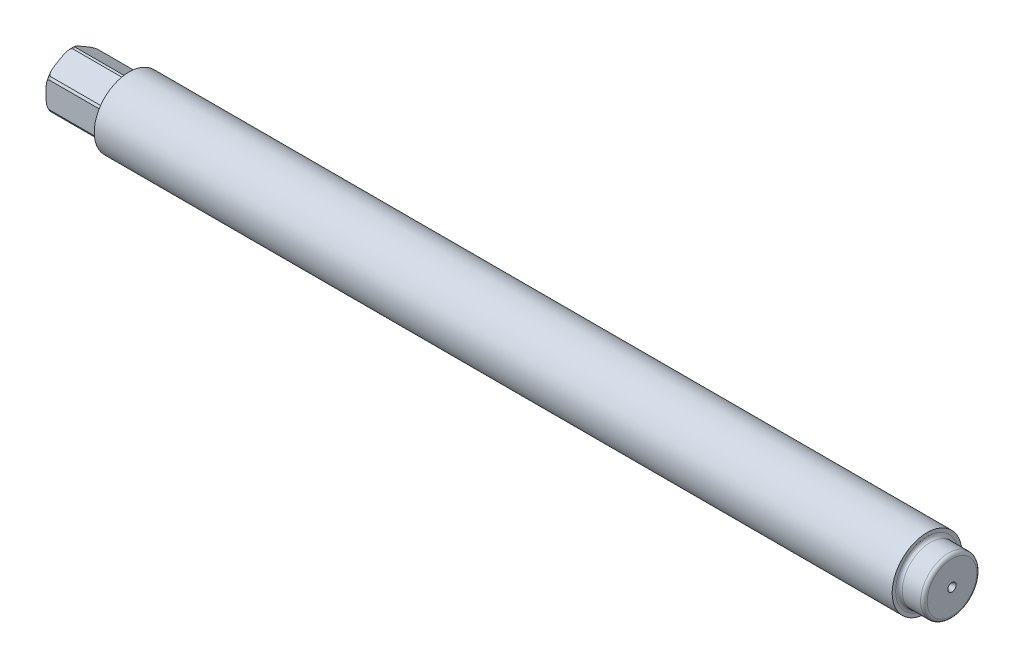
ISO-10303-21;
HEADER;
FILE_DESCRIPTION(('STEP AP214'),'2;1');
FILE_NAME('part.step','',(''),(''),'','','');
FILE_SCHEMA(('AUTOMOTIVE_DESIGN { 1 0 10303 214 1 1 1 1 }'));
ENDSEC;
DATA;
#1=APPLICATION_CONTEXT('core data for automotive mechanical design processes');
#2=APPLICATION_PROTOCOL_DEFINITION('international standard','automotive_design',2000,#1);
#3=PRODUCT_CONTEXT('',#1,'mechanical');
#4=PRODUCT('Part','Part','',(#3));
#5=PRODUCT_RELATED_PRODUCT_CATEGORY('part','',(#4));
#6=PRODUCT_DEFINITION_FORMATION('','',#4);
#7=PRODUCT_DEFINITION_CONTEXT('part definition',#1,'design');
#8=PRODUCT_DEFINITION('design','',#6,#7);
#9=PRODUCT_DEFINITION_SHAPE('','',#8);
#10=(LENGTH_UNIT() NAMED_UNIT(*) SI_UNIT(.MILLI.,.METRE.));
#11=(NAMED_UNIT(*) PLANE_ANGLE_UNIT() SI_UNIT($,.RADIAN.));
#12=(NAMED_UNIT(*) SI_UNIT($,.STERADIAN.) SOLID_ANGLE_UNIT());
#13=UNCERTAINTY_MEASURE_WITH_UNIT(LENGTH_MEASURE(1.E-05),#10,'distance_accuracy_value','');
#14=(GEOMETRIC_REPRESENTATION_CONTEXT(3) GLOBAL_UNCERTAINTY_ASSIGNED_CONTEXT((#13)) GLOBAL_UNIT_ASSIGNED_CONTEXT((#10,
#11,#12)) REPRESENTATION_CONTEXT('',''));
#15=CARTESIAN_POINT('',(0.,0.,0.));
#16=DIRECTION('',(0.,0.,1.));
#17=DIRECTION('',(1.,0.,0.));
#18=AXIS2_PLACEMENT_3D('',#15,#16,#17);
#19=CARTESIAN_POINT('',(-96.,0.,0.));
#20=DIRECTION('',(-1.,0.,0.));
#21=DIRECTION('',(0.,0.,1.));
#22=AXIS2_PLACEMENT_3D('',#19,#20,#21);
#23=PLANE('',#22);
#24=DIRECTION('',(0.,1.,0.));
#25=VECTOR('',#24,1.);
#26=CARTESIAN_POINT('',(-96.,1.44337567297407,-2.5));
#27=LINE('',#26,#25);
#28=CARTESIAN_POINT('',(-96.,1.44337568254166,-2.49999999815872));
#29=VERTEX_POINT('',#28);
#30=CARTESIAN_POINT('',(-96.,-1.44337567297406,-2.5));
#31=VERTEX_POINT('',#30);
#32=EDGE_CURVE('E162',#29,#31,#27,.F.);
#33=ORIENTED_EDGE('',*,*,#32,.T.);
#34=DIRECTION('',(0.,0.5,-0.866025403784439));
#35=VECTOR('',#34,1.);
#36=CARTESIAN_POINT('',(-96.,-1.44337567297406,-2.5));
#37=LINE('',#36,#35);
#38=CARTESIAN_POINT('',(-96.,-2.88675135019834,-7.36164544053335E-09));
#39=VERTEX_POINT('',#38);
#40=EDGE_CURVE('E156',#31,#39,#37,.F.);
#41=ORIENTED_EDGE('',*,*,#40,.T.);
#42=DIRECTION('',(0.,-0.5,-0.866025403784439));
#43=VECTOR('',#42,1.);
#44=CARTESIAN_POINT('',(-96.,-2.88675134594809,0.));
#45=LINE('',#44,#43);
#46=CARTESIAN_POINT('',(-96.,-1.44337568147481,2.49999999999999));
#47=VERTEX_POINT('',#46);
#48=EDGE_CURVE('E159',#39,#47,#45,.F.);
#49=ORIENTED_EDGE('',*,*,#48,.T.);
#50=DIRECTION('',(0.,-1.,0.));
#51=VECTOR('',#50,1.);
#52=CARTESIAN_POINT('',(-96.,-1.44337567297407,2.5));
#53=LINE('',#52,#51);
#54=CARTESIAN_POINT('',(-96.,1.44337566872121,2.50000000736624));
#55=VERTEX_POINT('',#54);
#56=EDGE_CURVE('E178',#47,#55,#53,.F.);
#57=ORIENTED_EDGE('',*,*,#56,.T.);
#58=DIRECTION('',(0.,-0.5,0.866025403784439));
#59=VECTOR('',#58,1.);
#60=CARTESIAN_POINT('',(-96.,1.4433756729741,2.50000000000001));
#61=LINE('',#60,#59);
#62=CARTESIAN_POINT('',(-96.,2.88675135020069,7.3656204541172E-09));
#63=VERTEX_POINT('',#62);
#64=EDGE_CURVE('E494',#55,#63,#61,.F.);
#65=ORIENTED_EDGE('',*,*,#64,.T.);
#66=DIRECTION('',(0.,0.5,0.866025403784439));
#67=VECTOR('',#66,1.);
#68=CARTESIAN_POINT('',(-96.,2.88675134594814,0.));
#69=LINE('',#68,#67);
#70=EDGE_CURVE('E142',#63,#29,#69,.F.);
#71=ORIENTED_EDGE('',*,*,#70,.T.);
#72=EDGE_LOOP('',(#33,#41,#49,#57,#65,#71));
#73=FACE_BOUND('',#72,.T.);
#74=ADVANCED_FACE('F16',(#73),#23,.T.);
#75=CARTESIAN_POINT('',(-96.,-1.44337567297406,-2.5));
#76=DIRECTION('',(0.,-0.866025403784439,-0.5));
#77=DIRECTION('',(0.,0.5,-0.866025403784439));
#78=AXIS2_PLACEMENT_3D('',#75,#76,#77);
#79=PLANE('',#78);
#80=DIRECTION('',(1.,0.,0.));
#81=VECTOR('',#80,1.);
#82=CARTESIAN_POINT('',(-96.,-1.44337567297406,-2.5));
#83=LINE('',#82,#81);
#84=CARTESIAN_POINT('',(-109.803847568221,-1.44337566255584,-2.5));
#85=VERTEX_POINT('',#84);
#86=EDGE_CURVE('E485',#31,#85,#83,.F.);
#87=ORIENTED_EDGE('',*,*,#86,.T.);
#88=CARTESIAN_POINT('',(-109.803847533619,-1.44337569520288,-2.49999995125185));
#89=CARTESIAN_POINT('',(-109.75160611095,-1.47357352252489,-2.44769578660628));
#90=CARTESIAN_POINT('',(-109.700659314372,-1.50437536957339,-2.39434542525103));
#91=CARTESIAN_POINT('',(-109.602192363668,-1.56757631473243,-2.28487817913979));
#92=CARTESIAN_POINT('',(-109.554691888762,-1.59998304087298,-2.22874808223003));
#93=CARTESIAN_POINT('',(-109.463370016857,-1.66732509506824,-2.11210822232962));
#94=CARTESIAN_POINT('',(-109.419675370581,-1.7023041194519,-2.051522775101));
#95=CARTESIAN_POINT('',(-109.339265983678,-1.77413935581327,-1.92710049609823));
#96=CARTESIAN_POINT('',(-109.302535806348,-1.81099118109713,-1.86327126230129));
#97=CARTESIAN_POINT('',(-109.235404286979,-1.89002332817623,-1.72638356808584));
#98=CARTESIAN_POINT('',(-109.205840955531,-1.93238747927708,-1.65300670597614));
#99=CARTESIAN_POINT('',(-109.161095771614,-2.0186709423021,-1.50355936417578));
#100=CARTESIAN_POINT('',(-109.14579755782,-2.06257458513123,-1.42751602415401));
#101=CARTESIAN_POINT('',(-109.131482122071,-2.15147184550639,-1.27354145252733));
#102=CARTESIAN_POINT('',(-109.132612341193,-2.19647171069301,-1.19559939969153));
#103=CARTESIAN_POINT('',(-109.151334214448,-2.28568025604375,-1.04108566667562));
#104=CARTESIAN_POINT('',(-109.168969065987,-2.32988654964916,-0.964518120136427));
#105=CARTESIAN_POINT('',(-109.225181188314,-2.42877072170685,-0.793245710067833));
#106=CARTESIAN_POINT('',(-109.26834156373,-2.48277763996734,-0.699702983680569));
#107=CARTESIAN_POINT('',(-109.370660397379,-2.58697232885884,-0.519232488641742));
#108=CARTESIAN_POINT('',(-109.42989370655,-2.63714078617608,-0.432338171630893));
#109=CARTESIAN_POINT('',(-109.541529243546,-2.72097497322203,-0.287133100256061));
#110=CARTESIAN_POINT('',(-109.591524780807,-2.75546718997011,-0.227390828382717));
#111=CARTESIAN_POINT('',(-109.695181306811,-2.82243311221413,-0.111402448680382));
#112=CARTESIAN_POINT('',(-109.74879444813,-2.85492523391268,-0.05512444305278));
#113=CARTESIAN_POINT('',(-109.803847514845,-2.88675130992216,-6.23988015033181E-08));
#114=B_SPLINE_CURVE_WITH_KNOTS('',3,(#88,#89,#90,#91,#92,#93,#94,#95,#96,#97,#98,#99,#100,#101,
#102,#103,#104,#105,#106,#107,#108,#109,#110,#111,#112,#113),.UNSPECIFIED.,.F.,.F.,(4,2,2,2,2,2,
2,2,2,2,2,2,4),(0.,0.239644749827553,0.480564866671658,0.727709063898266,0.974298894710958,
1.24252371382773,1.50854096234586,1.77694711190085,2.04605772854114,2.39303213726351,
2.74165097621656,2.99707753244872,3.24961543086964),.UNSPECIFIED.);
#115=CARTESIAN_POINT('',(-109.803847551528,-2.88675133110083,-3.67586975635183E-08));
#116=VERTEX_POINT('',#115);
#117=EDGE_CURVE('E20',#85,#116,#114,.T.);
#118=ORIENTED_EDGE('',*,*,#117,.T.);
#119=DIRECTION('',(1.,0.,0.));
#120=VECTOR('',#119,1.);
#121=CARTESIAN_POINT('',(-96.,-2.88675135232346,-1.10424608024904E-08));
#122=LINE('',#121,#120);
#123=EDGE_CURVE('E164',#116,#39,#122,.T.);
#124=ORIENTED_EDGE('',*,*,#123,.T.);
#125=ORIENTED_EDGE('',*,*,#40,.F.);
#126=EDGE_LOOP('',(#87,#118,#124,#125));
#127=FACE_BOUND('',#126,.T.);
#128=ADVANCED_FACE('F167',(#127),#79,.F.);
#129=CARTESIAN_POINT('',(-96.,-2.88675134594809,0.));
#130=DIRECTION('',(0.,-0.866025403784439,0.5));
#131=DIRECTION('',(0.,-0.5,-0.866025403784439));
#132=AXIS2_PLACEMENT_3D('',#129,#130,#131);
#133=PLANE('',#132);
#134=ORIENTED_EDGE('',*,*,#123,.F.);
#135=CARTESIAN_POINT('',(-109.803847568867,-2.88675131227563,8.37684664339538E-09));
#136=CARTESIAN_POINT('',(-109.751606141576,-2.85655350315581,0.0523041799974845));
#137=CARTESIAN_POINT('',(-109.700659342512,-2.8257516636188,0.105654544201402));
#138=CARTESIAN_POINT('',(-109.60219238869,-2.76255072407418,0.215121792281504));
#139=CARTESIAN_POINT('',(-109.554691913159,-2.73014399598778,0.271251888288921));
#140=CARTESIAN_POINT('',(-109.463370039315,-2.66280194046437,0.387891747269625));
#141=CARTESIAN_POINT('',(-109.419675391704,-2.62782291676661,0.448477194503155));
#142=CARTESIAN_POINT('',(-109.339266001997,-2.55598768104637,0.57289947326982));
#143=CARTESIAN_POINT('',(-109.302535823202,-2.51913585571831,0.636728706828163));
#144=CARTESIAN_POINT('',(-109.235404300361,-2.4401037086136,0.773616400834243));
#145=CARTESIAN_POINT('',(-109.205840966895,-2.39773955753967,0.846993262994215));
#146=CARTESIAN_POINT('',(-109.161095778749,-2.3114560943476,0.996440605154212));
#147=CARTESIAN_POINT('',(-109.145797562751,-2.26755245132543,1.07248394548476));
#148=CARTESIAN_POINT('',(-109.131482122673,-2.1786551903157,1.22645851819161));
#149=CARTESIAN_POINT('',(-109.132612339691,-2.13365532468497,1.30440057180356));
#150=CARTESIAN_POINT('',(-109.151334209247,-2.04444677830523,1.45891430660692));
#151=CARTESIAN_POINT('',(-109.168969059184,-2.00024048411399,1.53548185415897));
#152=CARTESIAN_POINT('',(-109.2251811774,-1.90135631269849,1.7067542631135));
#153=CARTESIAN_POINT('',(-109.268341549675,-1.84734939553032,1.80029698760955));
#154=CARTESIAN_POINT('',(-109.370660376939,-1.74315470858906,1.98076747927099));
#155=CARTESIAN_POINT('',(-109.429893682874,-1.69298625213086,2.06766179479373));
#156=CARTESIAN_POINT('',(-109.541529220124,-1.60915206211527,2.21286687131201));
#157=CARTESIAN_POINT('',(-109.591524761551,-1.57465984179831,2.27260914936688));
#158=CARTESIAN_POINT('',(-109.695181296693,-1.50769391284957,2.38859754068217));
#159=CARTESIAN_POINT('',(-109.748794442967,-1.47520178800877,2.44487555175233));
#160=CARTESIAN_POINT('',(-109.803847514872,-1.44337570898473,2.49999993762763));
#161=B_SPLINE_CURVE_WITH_KNOTS('',3,(#135,#136,#137,#138,#139,#140,#141,#142,#143,#144,#145,
#146,#147,#148,#149,#150,#151,#152,#153,#154,#155,#156,#157,#158,#159,#160),.UNSPECIFIED.,.F.,
.F.,(4,2,2,2,2,2,2,2,2,2,2,2,4),(0.,0.239644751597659,0.480564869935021,0.727709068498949,
0.974298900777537,1.2425237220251,1.50854097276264,1.77694712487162,2.04605774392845,
2.39303214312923,2.74165097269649,2.9970775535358,3.24961547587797),.UNSPECIFIED.);
#162=CARTESIAN_POINT('',(-109.803847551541,-1.44337569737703,2.49999996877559));
#163=VERTEX_POINT('',#162);
#164=EDGE_CURVE('E349',#116,#163,#161,.T.);
#165=ORIENTED_EDGE('',*,*,#164,.T.);
#166=DIRECTION('',(1.,0.,0.));
#167=VECTOR('',#166,1.);
#168=CARTESIAN_POINT('',(-96.,-1.4433756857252,2.5));
#169=LINE('',#168,#167);
#170=EDGE_CURVE('E175',#163,#47,#169,.T.);
#171=ORIENTED_EDGE('',*,*,#170,.T.);
#172=ORIENTED_EDGE('',*,*,#48,.F.);
#173=EDGE_LOOP('',(#134,#165,#171,#172));
#174=FACE_BOUND('',#173,.T.);
#175=ADVANCED_FACE('F173',(#174),#133,.F.);
#176=CARTESIAN_POINT('',(-96.,-1.44337567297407,2.5));
#177=DIRECTION('',(0.,0.,1.));
#178=DIRECTION('',(0.,-1.,0.));
#179=AXIS2_PLACEMENT_3D('',#176,#177,#178);
#180=PLANE('',#179);
#181=ORIENTED_EDGE('',*,*,#170,.F.);
#182=CARTESIAN_POINT('',(-109.803847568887,-1.44337564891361,2.49999997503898));
#183=CARTESIAN_POINT('',(-109.751590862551,-1.38296268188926,2.49999999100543));
#184=CARTESIAN_POINT('',(-109.700629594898,-1.32134050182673,2.49999999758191));
#185=CARTESIAN_POINT('',(-109.602134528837,-1.19489772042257,2.50000000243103));
#186=CARTESIAN_POINT('',(-109.554620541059,-1.130061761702,2.50000000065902));
#187=CARTESIAN_POINT('',(-109.46330296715,-0.995371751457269,2.49999999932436));
#188=CARTESIAN_POINT('',(-109.419623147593,-0.925432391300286,2.49999999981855));
#189=CARTESIAN_POINT('',(-109.339243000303,-0.781800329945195,2.50000000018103));
#190=CARTESIAN_POINT('',(-109.302526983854,-0.708116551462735,2.50000000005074));
#191=CARTESIAN_POINT('',(-109.23459319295,-0.548178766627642,2.49999999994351));
#192=CARTESIAN_POINT('',(-109.204469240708,-0.461446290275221,2.49999999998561));
#193=CARTESIAN_POINT('',(-109.159379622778,-0.284706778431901,2.50000000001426));
#194=CARTESIAN_POINT('',(-109.144281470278,-0.194735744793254,2.5000000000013));
#195=CARTESIAN_POINT('',(-109.136485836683,-0.0869384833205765,2.49999999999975));
#196=CARTESIAN_POINT('',(-109.135546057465,-0.0695728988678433,2.49999999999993));
#197=CARTESIAN_POINT('',(-109.134289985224,-0.0348058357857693,2.50000000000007));
#198=CARTESIAN_POINT('',(-109.133974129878,-0.0174043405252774,2.50000000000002));
#199=CARTESIAN_POINT('',(-109.133975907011,0.0489223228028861,2.49999999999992));
#200=CARTESIAN_POINT('',(-109.136476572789,0.0978671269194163,2.49999999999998));
#201=CARTESIAN_POINT('',(-109.14634421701,0.195279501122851,2.50000000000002));
#202=CARTESIAN_POINT('',(-109.153715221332,0.243746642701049,2.50000000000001));
#203=CARTESIAN_POINT('',(-109.18271059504,0.388050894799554,2.49999999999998));
#204=CARTESIAN_POINT('',(-109.211214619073,0.482534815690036,2.49999999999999));
#205=CARTESIAN_POINT('',(-109.297145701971,0.704384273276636,2.5));
#206=CARTESIAN_POINT('',(-109.3616930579,0.828886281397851,2.5));
#207=CARTESIAN_POINT('',(-109.471314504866,1.0073900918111,2.5));
#208=CARTESIAN_POINT('',(-109.510051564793,1.06559209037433,2.5));
#209=CARTESIAN_POINT('',(-109.590927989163,1.17958412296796,2.5));
#210=CARTESIAN_POINT('',(-109.633066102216,1.23537503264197,2.5));
#211=CARTESIAN_POINT('',(-109.697224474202,1.31614857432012,2.5));
#212=CARTESIAN_POINT('',(-109.718221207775,1.34196145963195,2.5));
#213=CARTESIAN_POINT('',(-109.760681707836,1.39304266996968,2.5));
#214=CARTESIAN_POINT('',(-109.782143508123,1.41831262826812,2.5));
#215=CARTESIAN_POINT('',(-109.80384751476,1.44337560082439,2.5));
#216=B_SPLINE_CURVE_WITH_KNOTS('',3,(#182,#183,#184,#185,#186,#187,#188,#189,#190,#191,#192,
#193,#194,#195,#196,#197,#198,#199,#200,#201,#202,#203,#204,#205,#206,#207,#208,#209,#210,#211,
#212,#213,#214,#215),.UNSPECIFIED.,.F.,.F.,(4,2,2,2,2,2,2,2,2,2,2,2,2,2,2,2,4),(0.,
0.239714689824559,0.480712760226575,0.727787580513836,0.974298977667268,1.24873212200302,
1.52072348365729,1.57289089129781,1.62509488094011,1.77183646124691,1.91869949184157,
2.21318035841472,2.63138652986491,2.84107695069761,3.05069056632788,3.1505088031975,
3.24996563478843),.UNSPECIFIED.);
#217=CARTESIAN_POINT('',(-109.803847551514,1.44337563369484,2.50000000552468));
#218=VERTEX_POINT('',#217);
#219=EDGE_CURVE('E355',#163,#218,#216,.T.);
#220=ORIENTED_EDGE('',*,*,#219,.T.);
#221=DIRECTION('',(1.,0.,0.));
#222=VECTOR('',#221,1.);
#223=CARTESIAN_POINT('',(-96.,1.44337566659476,2.50000001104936));
#224=LINE('',#223,#222);
#225=EDGE_CURVE('E497',#218,#55,#224,.T.);
#226=ORIENTED_EDGE('',*,*,#225,.T.);
#227=ORIENTED_EDGE('',*,*,#56,.F.);
#228=EDGE_LOOP('',(#181,#220,#226,#227));
#229=FACE_BOUND('',#228,.T.);
#230=ADVANCED_FACE('F363',(#229),#180,.F.);
#231=CARTESIAN_POINT('',(-96.,1.4433756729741,2.50000000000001));
#232=DIRECTION('',(0.,0.866025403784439,0.5));
#233=DIRECTION('',(0.,-0.5,0.866025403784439));
#234=AXIS2_PLACEMENT_3D('',#231,#232,#233);
#235=PLANE('',#234);
#236=ORIENTED_EDGE('',*,*,#225,.F.);
#237=CARTESIAN_POINT('',(-109.803847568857,1.44337566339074,2.49999996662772));
#238=CARTESIAN_POINT('',(-109.751606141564,1.47357350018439,2.44769581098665));
#239=CARTESIAN_POINT('',(-109.7006593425,1.50437535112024,2.39434545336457));
#240=CARTESIAN_POINT('',(-109.602192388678,1.56757629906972,2.28487821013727));
#241=CARTESIAN_POINT('',(-109.554691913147,1.59998302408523,2.22874811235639));
#242=CARTESIAN_POINT('',(-109.463370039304,1.66732507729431,2.11210825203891));
#243=CARTESIAN_POINT('',(-109.419675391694,1.70230410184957,2.05152280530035));
#244=CARTESIAN_POINT('',(-109.339266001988,1.77413933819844,1.9271005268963));
#245=CARTESIAN_POINT('',(-109.302535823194,1.81099116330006,1.863271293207));
#246=CARTESIAN_POINT('',(-109.235404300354,1.89002331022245,1.72638359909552));
#247=CARTESIAN_POINT('',(-109.20584096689,1.93238746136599,1.65300673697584));
#248=CARTESIAN_POINT('',(-109.161095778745,2.01867092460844,1.50355939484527));
#249=CARTESIAN_POINT('',(-109.145797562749,2.06257456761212,1.4275160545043));
#250=CARTESIAN_POINT('',(-109.131482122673,2.15147182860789,1.27354148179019));
#251=CARTESIAN_POINT('',(-109.132612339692,2.19647169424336,1.19559942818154));
#252=CARTESIAN_POINT('',(-109.151334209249,2.28568024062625,1.04108569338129));
#253=CARTESIAN_POINT('',(-109.168969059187,2.32988653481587,0.964518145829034));
#254=CARTESIAN_POINT('',(-109.225181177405,2.42877070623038,0.79324573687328));
#255=CARTESIAN_POINT('',(-109.268341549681,2.48277762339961,0.699703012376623));
#256=CARTESIAN_POINT('',(-109.370660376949,2.58697231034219,0.519232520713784));
#257=CARTESIAN_POINT('',(-109.429893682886,2.63714076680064,0.432338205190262));
#258=CARTESIAN_POINT('',(-109.541529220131,2.72097495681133,0.287133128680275));
#259=CARTESIAN_POINT('',(-109.59152476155,2.7554671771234,0.22739085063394));
#260=CARTESIAN_POINT('',(-109.695181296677,2.8224331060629,0.11140245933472));
#261=CARTESIAN_POINT('',(-109.748794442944,2.85492523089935,0.0551244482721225));
#262=CARTESIAN_POINT('',(-109.80384751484,2.88675130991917,6.24040611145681E-08));
#263=B_SPLINE_CURVE_WITH_KNOTS('',3,(#237,#238,#239,#240,#241,#242,#243,#244,#245,#246,#247,
#248,#249,#250,#251,#252,#253,#254,#255,#256,#257,#258,#259,#260,#261,#262),.UNSPECIFIED.,.F.,
.F.,(4,2,2,2,2,2,2,2,2,2,2,2,4),(0.,0.239644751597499,0.480564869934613,0.727709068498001,
0.974298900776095,1.24252372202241,1.50854097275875,1.77694712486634,2.0460577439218,
2.39303214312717,2.74165097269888,2.99707755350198,3.24961547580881),.UNSPECIFIED.);
#264=CARTESIAN_POINT('',(-109.803847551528,2.88675133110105,3.67643570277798E-08));
#265=VERTEX_POINT('',#264);
#266=EDGE_CURVE('E339',#218,#265,#263,.T.);
#267=ORIENTED_EDGE('',*,*,#266,.T.);
#268=DIRECTION('',(1.,0.,0.));
#269=VECTOR('',#268,1.);
#270=CARTESIAN_POINT('',(-96.,2.88675135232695,1.10484235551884E-08));
#271=LINE('',#270,#269);
#272=EDGE_CURVE('E491',#265,#63,#271,.T.);
#273=ORIENTED_EDGE('',*,*,#272,.T.);
#274=ORIENTED_EDGE('',*,*,#64,.F.);
#275=EDGE_LOOP('',(#236,#267,#273,#274));
#276=FACE_BOUND('',#275,.T.);
#277=ADVANCED_FACE('F521',(#276),#235,.F.);
#278=CARTESIAN_POINT('',(-96.,2.88675134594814,0.));
#279=DIRECTION('',(0.,0.866025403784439,-0.5));
#280=DIRECTION('',(0.,0.5,0.866025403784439));
#281=AXIS2_PLACEMENT_3D('',#278,#279,#280);
#282=PLANE('',#281);
#283=ORIENTED_EDGE('',*,*,#272,.F.);
#284=CARTESIAN_POINT('',(-109.803847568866,2.88675131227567,-8.37777955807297E-09));
#285=CARTESIAN_POINT('',(-109.751606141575,2.85655350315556,-0.052304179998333));
#286=CARTESIAN_POINT('',(-109.700659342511,2.82575166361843,-0.105654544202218));
#287=CARTESIAN_POINT('',(-109.60219238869,2.76255072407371,-0.215121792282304));
#288=CARTESIAN_POINT('',(-109.554691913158,2.73014399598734,-0.271251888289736));
#289=CARTESIAN_POINT('',(-109.463370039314,2.66280194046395,-0.387891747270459));
#290=CARTESIAN_POINT('',(-109.419675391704,2.62782291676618,-0.448477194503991));
#291=CARTESIAN_POINT('',(-109.339266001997,2.55598768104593,-0.572899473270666));
#292=CARTESIAN_POINT('',(-109.302535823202,2.51913585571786,-0.636728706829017));
#293=CARTESIAN_POINT('',(-109.23540430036,2.44010370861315,-0.773616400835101));
#294=CARTESIAN_POINT('',(-109.205840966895,2.39773955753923,-0.84699326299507));
#295=CARTESIAN_POINT('',(-109.161095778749,2.31145609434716,-0.996440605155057));
#296=CARTESIAN_POINT('',(-109.145797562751,2.26755245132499,-1.07248394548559));
#297=CARTESIAN_POINT('',(-109.131482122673,2.17865519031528,-1.22645851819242));
#298=CARTESIAN_POINT('',(-109.132612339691,2.13365532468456,-1.30440057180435));
#299=CARTESIAN_POINT('',(-109.151334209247,2.04444677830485,-1.45891430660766));
#300=CARTESIAN_POINT('',(-109.168969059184,2.00024048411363,-1.53548185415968));
#301=CARTESIAN_POINT('',(-109.2251811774,1.90135631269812,-1.70675426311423));
#302=CARTESIAN_POINT('',(-109.268341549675,1.84734939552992,-1.80029698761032));
#303=CARTESIAN_POINT('',(-109.37066037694,1.7431547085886,-1.98076747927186));
#304=CARTESIAN_POINT('',(-109.429893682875,1.69298625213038,-2.06766179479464));
#305=CARTESIAN_POINT('',(-109.541529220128,1.60915206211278,-2.21286687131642));
#306=CARTESIAN_POINT('',(-109.591524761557,1.57465984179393,-2.27260914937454));
#307=CARTESIAN_POINT('',(-109.695181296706,1.50769391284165,-2.38859754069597));
#308=CARTESIAN_POINT('',(-109.748794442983,1.47520178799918,-2.44487555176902));
#309=CARTESIAN_POINT('',(-109.803847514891,1.44337570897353,-2.49999993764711));
#310=B_SPLINE_CURVE_WITH_KNOTS('',3,(#284,#285,#286,#287,#288,#289,#290,#291,#292,#293,#294,
#295,#296,#297,#298,#299,#300,#301,#302,#303,#304,#305,#306,#307,#308,#309),.UNSPECIFIED.,.F.,
.F.,(4,2,2,2,2,2,2,2,2,2,2,2,4),(0.,0.239644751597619,0.480564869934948,0.727709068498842,
0.974298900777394,1.24252372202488,1.50854097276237,1.77694712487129,2.04605774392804,
2.39303214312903,2.7416509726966,2.99707755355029,3.24961547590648),.UNSPECIFIED.);
#311=CARTESIAN_POINT('',(-109.803847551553,1.4433756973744,-2.49999996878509));
#312=VERTEX_POINT('',#311);
#313=EDGE_CURVE('E321',#265,#312,#310,.T.);
#314=ORIENTED_EDGE('',*,*,#313,.T.);
#315=DIRECTION('',(1.,0.,0.));
#316=VECTOR('',#315,1.);
#317=CARTESIAN_POINT('',(-96.,1.44337568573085,-2.5));
#318=LINE('',#317,#316);
#319=EDGE_CURVE('E483',#312,#29,#318,.T.);
#320=ORIENTED_EDGE('',*,*,#319,.T.);
#321=ORIENTED_EDGE('',*,*,#70,.F.);
#322=EDGE_LOOP('',(#283,#314,#320,#321));
#323=FACE_BOUND('',#322,.T.);
#324=ADVANCED_FACE('F525',(#323),#282,.F.);
#325=CARTESIAN_POINT('',(-96.,1.44337567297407,-2.5));
#326=DIRECTION('',(0.,0.,-1.));
#327=DIRECTION('',(0.,1.,0.));
#328=AXIS2_PLACEMENT_3D('',#325,#326,#327);
#329=PLANE('',#328);
#330=ORIENTED_EDGE('',*,*,#319,.F.);
#331=CARTESIAN_POINT('',(-109.803847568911,1.44337564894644,-2.49999997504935));
#332=CARTESIAN_POINT('',(-109.751590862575,1.38296268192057,-2.49999999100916));
#333=CARTESIAN_POINT('',(-109.700629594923,1.32134050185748,-2.49999999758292));
#334=CARTESIAN_POINT('',(-109.60213452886,1.19489772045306,-2.50000000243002));
#335=CARTESIAN_POINT('',(-109.554620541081,1.1300617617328,-2.50000000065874));
#336=CARTESIAN_POINT('',(-109.46330296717,0.995371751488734,-2.49999999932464));
#337=CARTESIAN_POINT('',(-109.419623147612,0.925432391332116,-2.49999999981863));
#338=CARTESIAN_POINT('',(-109.33924300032,0.781800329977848,-2.50000000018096));
#339=CARTESIAN_POINT('',(-109.302526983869,0.708116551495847,-2.50000000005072));
#340=CARTESIAN_POINT('',(-109.234593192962,0.548178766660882,-2.49999999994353));
#341=CARTESIAN_POINT('',(-109.204469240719,0.461446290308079,-2.49999999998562));
#342=CARTESIAN_POINT('',(-109.159379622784,0.284706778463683,-2.50000000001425));
#343=CARTESIAN_POINT('',(-109.144281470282,0.194735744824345,-2.5000000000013));
#344=CARTESIAN_POINT('',(-109.136485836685,0.0869384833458,-2.49999999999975));
#345=CARTESIAN_POINT('',(-109.135546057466,0.0695728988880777,-2.49999999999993));
#346=CARTESIAN_POINT('',(-109.134289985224,0.034805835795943,-2.50000000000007));
#347=CARTESIAN_POINT('',(-109.133974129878,0.0174043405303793,-2.50000000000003));
#348=CARTESIAN_POINT('',(-109.133975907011,-0.048922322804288,-2.49999999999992));
#349=CARTESIAN_POINT('',(-109.136476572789,-0.0978671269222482,-2.49999999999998));
#350=CARTESIAN_POINT('',(-109.146344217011,-0.195279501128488,-2.50000000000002));
#351=CARTESIAN_POINT('',(-109.153715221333,-0.243746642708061,-2.50000000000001));
#352=CARTESIAN_POINT('',(-109.182710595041,-0.388050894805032,-2.49999999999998));
#353=CARTESIAN_POINT('',(-109.211214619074,-0.482534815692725,-2.49999999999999));
#354=CARTESIAN_POINT('',(-109.297145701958,-0.704384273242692,-2.5));
#355=CARTESIAN_POINT('',(-109.361693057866,-0.82888628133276,-2.5));
#356=CARTESIAN_POINT('',(-109.471314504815,-1.00739009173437,-2.5));
#357=CARTESIAN_POINT('',(-109.510051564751,-1.06559209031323,-2.5));
#358=CARTESIAN_POINT('',(-109.59092798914,-1.17958412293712,-2.5));
#359=CARTESIAN_POINT('',(-109.633066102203,-1.23537503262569,-2.5));
#360=CARTESIAN_POINT('',(-109.69722448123,-1.31614858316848,-2.5));
#361=CARTESIAN_POINT('',(-109.718221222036,-1.34196147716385,-2.5));
#362=CARTESIAN_POINT('',(-109.760681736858,-1.39304270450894,-2.5));
#363=CARTESIAN_POINT('',(-109.782143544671,-1.41831267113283,-2.5));
#364=CARTESIAN_POINT('',(-109.803847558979,-1.44337565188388,-2.5));
#365=B_SPLINE_CURVE_WITH_KNOTS('',3,(#331,#332,#333,#334,#335,#336,#337,#338,#339,#340,#341,
#342,#343,#344,#345,#346,#347,#348,#349,#350,#351,#352,#353,#354,#355,#356,#357,#358,#359,#360,
#361,#362,#363,#364),.UNSPECIFIED.,.F.,.F.,(4,2,2,2,2,2,2,2,2,2,2,2,2,2,2,2,4),(0.,
0.239714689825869,0.480712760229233,0.727787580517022,0.974298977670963,1.2487321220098,
1.52072348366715,1.5728908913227,1.62509488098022,1.7718364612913,1.91869949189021,
2.21318035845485,2.63138652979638,2.84107695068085,3.05069056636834,3.15050883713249,
3.24996570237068),.UNSPECIFIED.);
#366=EDGE_CURVE('E133',#312,#85,#365,.T.);
#367=ORIENTED_EDGE('',*,*,#366,.T.);
#368=ORIENTED_EDGE('',*,*,#86,.F.);
#369=ORIENTED_EDGE('',*,*,#32,.F.);
#370=EDGE_LOOP('',(#330,#367,#368,#369));
#371=FACE_BOUND('',#370,.T.);
#372=ADVANCED_FACE('F328',(#371),#329,.F.);
#373=CARTESIAN_POINT('',(-110.000000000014,0.,0.));
#374=DIRECTION('',(-1.,0.,0.));
#375=DIRECTION('',(0.,0.,1.));
#376=AXIS2_PLACEMENT_3D('',#373,#374,#375);
#377=CONICAL_SURFACE('',#376,3.00000000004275,0.523598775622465);
#378=ORIENTED_EDGE('',*,*,#219,.F.);
#379=ORIENTED_EDGE('',*,*,#164,.F.);
#380=ORIENTED_EDGE('',*,*,#117,.F.);
#381=ORIENTED_EDGE('',*,*,#366,.F.);
#382=ORIENTED_EDGE('',*,*,#313,.F.);
#383=ORIENTED_EDGE('',*,*,#266,.F.);
#384=EDGE_LOOP('',(#378,#379,#380,#381,#382,#383));
#385=FACE_BOUND('',#384,.T.);
#386=CARTESIAN_POINT('',(-110.000000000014,0.,0.));
#387=DIRECTION('',(-1.,0.,0.));
#388=DIRECTION('',(0.,0.,1.));
#389=AXIS2_PLACEMENT_3D('',#386,#387,#388);
#390=CIRCLE('',#389,3.00000000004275);
#391=CARTESIAN_POINT('',(-110.000000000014,0.,3.00000000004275));
#392=VERTEX_POINT('',#391);
#393=EDGE_CURVE('E312',#392,#392,#390,.T.);
#394=ORIENTED_EDGE('',*,*,#393,.T.);
#395=EDGE_LOOP('',(#394));
#396=FACE_BOUND('',#395,.T.);
#397=ADVANCED_FACE('F330',(#385,#396),#377,.F.);
#398=CARTESIAN_POINT('',(101.999999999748,0.,0.));
#399=DIRECTION('',(1.,0.,0.));
#400=DIRECTION('',(0.,0.,-1.));
#401=AXIS2_PLACEMENT_3D('',#398,#399,#400);
#402=CONICAL_SURFACE('',#401,0.999999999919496,0.523598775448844);
#403=CARTESIAN_POINT('',(100.2679491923,0.,-2.8421709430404E-11));
#404=VERTEX_POINT('',#403);
#405=VERTEX_LOOP('',#404);
#406=FACE_BOUND('',#405,.T.);
#407=CARTESIAN_POINT('',(101.999999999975,0.,0.));
#408=DIRECTION('',(1.,0.,0.));
#409=DIRECTION('',(0.,0.,-1.));
#410=AXIS2_PLACEMENT_3D('',#407,#408,#409);
#411=CIRCLE('',#410,1.00000000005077);
#412=CARTESIAN_POINT('',(101.999999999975,0.,-1.00000000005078));
#413=VERTEX_POINT('',#412);
#414=EDGE_CURVE('E308',#413,#413,#411,.T.);
#415=ORIENTED_EDGE('',*,*,#414,.T.);
#416=EDGE_LOOP('',(#415));
#417=FACE_BOUND('',#416,.T.);
#418=ADVANCED_FACE('F334',(#406,#417),#402,.F.);
#419=CARTESIAN_POINT('',(-110.,3.00000000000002,0.));
#420=DIRECTION('',(1.,0.,0.));
#421=DIRECTION('',(0.,0.,-1.));
#422=AXIS2_PLACEMENT_3D('',#419,#420,#421);
#423=PLANE('',#422);
#424=ORIENTED_EDGE('',*,*,#393,.F.);
#425=EDGE_LOOP('',(#424));
#426=FACE_BOUND('',#425,.T.);
#427=CARTESIAN_POINT('',(-110.,0.,0.));
#428=DIRECTION('',(-1.,0.,0.));
#429=DIRECTION('',(0.,0.,1.));
#430=AXIS2_PLACEMENT_3D('',#427,#428,#429);
#431=CIRCLE('',#430,5.95);
#432=CARTESIAN_POINT('',(-110.,0.,5.95));
#433=VERTEX_POINT('',#432);
#434=EDGE_CURVE('E303',#433,#433,#431,.F.);
#435=ORIENTED_EDGE('',*,*,#434,.F.);
#436=EDGE_LOOP('',(#435));
#437=FACE_BOUND('',#436,.T.);
#438=ADVANCED_FACE('F529',(#426,#437),#423,.F.);
#439=CARTESIAN_POINT('',(102.,5.95000000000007,0.));
#440=DIRECTION('',(-1.,0.,0.));
#441=DIRECTION('',(0.,0.,1.));
#442=AXIS2_PLACEMENT_3D('',#439,#440,#441);
#443=PLANE('',#442);
#444=CARTESIAN_POINT('',(102.,0.,0.));
#445=DIRECTION('',(-1.,0.,0.));
#446=DIRECTION('',(0.,0.,1.));
#447=AXIS2_PLACEMENT_3D('',#444,#445,#446);
#448=CIRCLE('',#447,5.94999999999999);
#449=CARTESIAN_POINT('',(102.,0.,5.94999999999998));
#450=VERTEX_POINT('',#449);
#451=EDGE_CURVE('E300',#450,#450,#448,.T.);
#452=ORIENTED_EDGE('',*,*,#451,.F.);
#453=EDGE_LOOP('',(#452));
#454=FACE_BOUND('',#453,.T.);
#455=ORIENTED_EDGE('',*,*,#414,.F.);
#456=EDGE_LOOP('',(#455));
#457=FACE_BOUND('',#456,.T.);
#458=ADVANCED_FACE('F532',(#454,#457),#443,.F.);
#459=CARTESIAN_POINT('',(-108.,0.,0.));
#460=DIRECTION('',(-1.,0.,0.));
#461=DIRECTION('',(0.,0.,1.));
#462=AXIS2_PLACEMENT_3D('',#459,#460,#461);
#463=CYLINDRICAL_SURFACE('',#462,6.75000000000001);
#464=DIRECTION('',(1.,0.,0.));
#465=VECTOR('',#464,1.);
#466=CARTESIAN_POINT('',(-96.8,6.74231703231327,0.321964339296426));
#467=LINE('',#466,#465);
#468=CARTESIAN_POINT('',(-96.8,6.74231703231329,0.3219643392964));
#469=VERTEX_POINT('',#468);
#470=CARTESIAN_POINT('',(-109.2,6.74231703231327,0.321964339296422));
#471=VERTEX_POINT('',#470);
#472=EDGE_CURVE('E299',#469,#471,#467,.F.);
#473=ORIENTED_EDGE('',*,*,#472,.F.);
#474=CARTESIAN_POINT('',(-96.8,0.,0.));
#475=DIRECTION('',(-1.,0.,0.));
#476=DIRECTION('',(0.,0.,1.));
#477=AXIS2_PLACEMENT_3D('',#474,#475,#476);
#478=CIRCLE('',#477,6.75000000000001);
#479=CARTESIAN_POINT('',(-96.8,6.74231703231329,-0.321964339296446));
#480=VERTEX_POINT('',#479);
#481=EDGE_CURVE('E311',#469,#480,#478,.T.);
#482=ORIENTED_EDGE('',*,*,#481,.T.);
#483=DIRECTION('',(1.,0.,0.));
#484=VECTOR('',#483,1.);
#485=CARTESIAN_POINT('',(-96.8,6.74231703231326,-0.321964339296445));
#486=LINE('',#485,#484);
#487=CARTESIAN_POINT('',(-109.2,6.74231703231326,-0.321964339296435));
#488=VERTEX_POINT('',#487);
#489=EDGE_CURVE('E289',#488,#480,#486,.T.);
#490=ORIENTED_EDGE('',*,*,#489,.F.);
#491=CARTESIAN_POINT('',(-109.2,0.,0.));
#492=DIRECTION('',(-1.,0.,0.));
#493=DIRECTION('',(0.,-1.,0.));
#494=AXIS2_PLACEMENT_3D('',#491,#492,#493);
#495=CIRCLE('',#494,6.75);
#496=EDGE_CURVE('E469',#471,#488,#495,.T.);
#497=ORIENTED_EDGE('',*,*,#496,.F.);
#498=EDGE_LOOP('',(#473,#482,#490,#497));
#499=FACE_BOUND('',#498,.T.);
#500=ADVANCED_FACE('F539',(#499),#463,.T.);
#501=CARTESIAN_POINT('',(-108.,0.,0.));
#502=DIRECTION('',(-1.,0.,0.));
#503=DIRECTION('',(0.,0.,1.));
#504=AXIS2_PLACEMENT_3D('',#501,#502,#503);
#505=CYLINDRICAL_SURFACE('',#504,6.75000000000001);
#506=DIRECTION('',(1.,0.,0.));
#507=VECTOR('',#506,1.);
#508=CARTESIAN_POINT('',(-96.8,3.09232921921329,-6.));
#509=LINE('',#508,#507);
#510=CARTESIAN_POINT('',(-109.2,3.09232921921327,-6.));
#511=VERTEX_POINT('',#510);
#512=CARTESIAN_POINT('',(-96.8,3.09232921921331,-6.));
#513=VERTEX_POINT('',#512);
#514=EDGE_CURVE('E447',#511,#513,#509,.T.);
#515=ORIENTED_EDGE('',*,*,#514,.F.);
#516=CARTESIAN_POINT('',(-109.2,0.,0.));
#517=DIRECTION('',(-1.,0.,0.));
#518=DIRECTION('',(0.,-1.,0.));
#519=AXIS2_PLACEMENT_3D('',#516,#517,#518);
#520=CIRCLE('',#519,6.75);
#521=CARTESIAN_POINT('',(-109.2,3.64998781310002,-5.67803566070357));
#522=VERTEX_POINT('',#521);
#523=EDGE_CURVE('E307',#522,#511,#520,.T.);
#524=ORIENTED_EDGE('',*,*,#523,.F.);
#525=DIRECTION('',(1.,0.,0.));
#526=VECTOR('',#525,1.);
#527=CARTESIAN_POINT('',(-96.8,3.64998781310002,-5.67803566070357));
#528=LINE('',#527,#526);
#529=CARTESIAN_POINT('',(-96.8,3.64998781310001,-5.6780356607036));
#530=VERTEX_POINT('',#529);
#531=EDGE_CURVE('E290',#530,#522,#528,.F.);
#532=ORIENTED_EDGE('',*,*,#531,.F.);
#533=CARTESIAN_POINT('',(-96.8,0.,0.));
#534=DIRECTION('',(-1.,0.,0.));
#535=DIRECTION('',(0.,0.,1.));
#536=AXIS2_PLACEMENT_3D('',#533,#534,#535);
#537=CIRCLE('',#536,6.75000000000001);
#538=EDGE_CURVE('E479',#530,#513,#537,.T.);
#539=ORIENTED_EDGE('',*,*,#538,.T.);
#540=EDGE_LOOP('',(#515,#524,#532,#539));
#541=FACE_BOUND('',#540,.T.);
#542=ADVANCED_FACE('F546',(#541),#505,.T.);
#543=CARTESIAN_POINT('',(-108.,0.,0.));
#544=DIRECTION('',(-1.,0.,0.));
#545=DIRECTION('',(0.,0.,1.));
#546=AXIS2_PLACEMENT_3D('',#543,#544,#545);
#547=CYLINDRICAL_SURFACE('',#546,6.75000000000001);
#548=DIRECTION('',(1.,0.,0.));
#549=VECTOR('',#548,1.);
#550=CARTESIAN_POINT('',(-96.8,-3.09232921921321,-6.00000000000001));
#551=LINE('',#550,#549);
#552=CARTESIAN_POINT('',(-96.8,-3.09232921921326,-6.00000000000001));
#553=VERTEX_POINT('',#552);
#554=CARTESIAN_POINT('',(-109.2,-3.09232921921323,-6.00000000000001));
#555=VERTEX_POINT('',#554);
#556=EDGE_CURVE('E450',#553,#555,#551,.F.);
#557=ORIENTED_EDGE('',*,*,#556,.F.);
#558=CARTESIAN_POINT('',(-96.8,0.,0.));
#559=DIRECTION('',(-1.,0.,0.));
#560=DIRECTION('',(0.,0.,1.));
#561=AXIS2_PLACEMENT_3D('',#558,#559,#560);
#562=CIRCLE('',#561,6.75000000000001);
#563=CARTESIAN_POINT('',(-96.8,-3.64998781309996,-5.67803566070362));
#564=VERTEX_POINT('',#563);
#565=EDGE_CURVE('E477',#553,#564,#562,.T.);
#566=ORIENTED_EDGE('',*,*,#565,.T.);
#567=DIRECTION('',(1.,0.,0.));
#568=VECTOR('',#567,1.);
#569=CARTESIAN_POINT('',(-96.8,-3.64998781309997,-5.67803566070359));
#570=LINE('',#569,#568);
#571=CARTESIAN_POINT('',(-109.2,-3.64998781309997,-5.67803566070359));
#572=VERTEX_POINT('',#571);
#573=EDGE_CURVE('E254',#572,#564,#570,.T.);
#574=ORIENTED_EDGE('',*,*,#573,.F.);
#575=CARTESIAN_POINT('',(-109.2,0.,0.));
#576=DIRECTION('',(-1.,0.,0.));
#577=DIRECTION('',(0.,-1.,0.));
#578=AXIS2_PLACEMENT_3D('',#575,#576,#577);
#579=CIRCLE('',#578,6.75);
#580=EDGE_CURVE('E306',#555,#572,#579,.T.);
#581=ORIENTED_EDGE('',*,*,#580,.F.);
#582=EDGE_LOOP('',(#557,#566,#574,#581));
#583=FACE_BOUND('',#582,.T.);
#584=ADVANCED_FACE('F550',(#583),#547,.T.);
#585=CARTESIAN_POINT('',(-108.,0.,0.));
#586=DIRECTION('',(-1.,0.,0.));
#587=DIRECTION('',(0.,0.,1.));
#588=AXIS2_PLACEMENT_3D('',#585,#586,#587);
#589=CYLINDRICAL_SURFACE('',#588,6.75000000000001);
#590=DIRECTION('',(1.,0.,0.));
#591=VECTOR('',#590,1.);
#592=CARTESIAN_POINT('',(-96.8,-6.74231703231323,-0.321964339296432));
#593=LINE('',#592,#591);
#594=CARTESIAN_POINT('',(-96.8,-6.74231703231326,-0.321964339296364));
#595=VERTEX_POINT('',#594);
#596=CARTESIAN_POINT('',(-109.2,-6.74231703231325,-0.321964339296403));
#597=VERTEX_POINT('',#596);
#598=EDGE_CURVE('E255',#595,#597,#593,.F.);
#599=ORIENTED_EDGE('',*,*,#598,.F.);
#600=CARTESIAN_POINT('',(-96.8,0.,0.));
#601=DIRECTION('',(-1.,0.,0.));
#602=DIRECTION('',(0.,0.,1.));
#603=AXIS2_PLACEMENT_3D('',#600,#601,#602);
#604=CIRCLE('',#603,6.75000000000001);
#605=CARTESIAN_POINT('',(-96.8,-6.74231703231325,0.321964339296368));
#606=VERTEX_POINT('',#605);
#607=EDGE_CURVE('E475',#595,#606,#604,.T.);
#608=ORIENTED_EDGE('',*,*,#607,.T.);
#609=DIRECTION('',(1.,0.,0.));
#610=VECTOR('',#609,1.);
#611=CARTESIAN_POINT('',(-96.8,-6.74231703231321,0.321964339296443));
#612=LINE('',#611,#610);
#613=CARTESIAN_POINT('',(-109.2,-6.74231703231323,0.321964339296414));
#614=VERTEX_POINT('',#613);
#615=EDGE_CURVE('E437',#614,#606,#612,.T.);
#616=ORIENTED_EDGE('',*,*,#615,.F.);
#617=CARTESIAN_POINT('',(-109.2,0.,0.));
#618=DIRECTION('',(-1.,0.,0.));
#619=DIRECTION('',(0.,-1.,0.));
#620=AXIS2_PLACEMENT_3D('',#617,#618,#619);
#621=CIRCLE('',#620,6.75);
#622=EDGE_CURVE('E464',#597,#614,#621,.T.);
#623=ORIENTED_EDGE('',*,*,#622,.F.);
#624=EDGE_LOOP('',(#599,#608,#616,#623));
#625=FACE_BOUND('',#624,.T.);
#626=ADVANCED_FACE('F554',(#625),#589,.T.);
#627=CARTESIAN_POINT('',(-108.,0.,0.));
#628=DIRECTION('',(-1.,0.,0.));
#629=DIRECTION('',(0.,0.,1.));
#630=AXIS2_PLACEMENT_3D('',#627,#628,#629);
#631=CYLINDRICAL_SURFACE('',#630,6.75000000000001);
#632=DIRECTION('',(1.,0.,0.));
#633=VECTOR('',#632,1.);
#634=CARTESIAN_POINT('',(-96.8,3.09232921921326,6.));
#635=LINE('',#634,#633);
#636=CARTESIAN_POINT('',(-96.8,3.0923292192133,6.));
#637=VERTEX_POINT('',#636);
#638=CARTESIAN_POINT('',(-109.2,3.09232921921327,6.));
#639=VERTEX_POINT('',#638);
#640=EDGE_CURVE('E222',#637,#639,#635,.F.);
#641=ORIENTED_EDGE('',*,*,#640,.F.);
#642=CARTESIAN_POINT('',(-96.8,0.,0.));
#643=DIRECTION('',(-1.,0.,0.));
#644=DIRECTION('',(0.,0.,1.));
#645=AXIS2_PLACEMENT_3D('',#642,#643,#644);
#646=CIRCLE('',#645,6.75000000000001);
#647=CARTESIAN_POINT('',(-96.8,3.6499878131,5.67803566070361));
#648=VERTEX_POINT('',#647);
#649=EDGE_CURVE('E473',#637,#648,#646,.T.);
#650=ORIENTED_EDGE('',*,*,#649,.T.);
#651=DIRECTION('',(1.,0.,0.));
#652=VECTOR('',#651,1.);
#653=CARTESIAN_POINT('',(-96.8,3.64998781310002,5.67803566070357));
#654=LINE('',#653,#652);
#655=CARTESIAN_POINT('',(-109.2,3.64998781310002,5.67803566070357));
#656=VERTEX_POINT('',#655);
#657=EDGE_CURVE('E298',#656,#648,#654,.T.);
#658=ORIENTED_EDGE('',*,*,#657,.F.);
#659=CARTESIAN_POINT('',(-109.2,0.,0.));
#660=DIRECTION('',(-1.,0.,0.));
#661=DIRECTION('',(0.,-1.,0.));
#662=AXIS2_PLACEMENT_3D('',#659,#660,#661);
#663=CIRCLE('',#662,6.75);
#664=EDGE_CURVE('E471',#639,#656,#663,.T.);
#665=ORIENTED_EDGE('',*,*,#664,.F.);
#666=EDGE_LOOP('',(#641,#650,#658,#665));
#667=FACE_BOUND('',#666,.T.);
#668=ADVANCED_FACE('F239',(#667),#631,.T.);
#669=CARTESIAN_POINT('',(-109.2,0.,0.));
#670=DIRECTION('',(-1.,0.,0.));
#671=DIRECTION('',(0.,0.,1.));
#672=AXIS2_PLACEMENT_3D('',#669,#670,#671);
#673=TOROIDAL_SURFACE('',#672,5.95000000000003,0.799999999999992);
#674=CARTESIAN_POINT('',(-109.2,-3.09232921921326,-6.00000000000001));
#675=CARTESIAN_POINT('',(-109.222193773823,-3.09238415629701,-6.00000000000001));
#676=CARTESIAN_POINT('',(-109.244326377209,-3.0903165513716,-6.00000000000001));
#677=CARTESIAN_POINT('',(-109.287711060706,-3.0824204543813,-6.00000000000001));
#678=CARTESIAN_POINT('',(-109.308969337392,-3.07662648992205,-6.00000000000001));
#679=CARTESIAN_POINT('',(-109.35020841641,-3.06176952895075,-6.00000000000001));
#680=CARTESIAN_POINT('',(-109.370192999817,-3.05271679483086,-6.00000000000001));
#681=CARTESIAN_POINT('',(-109.408752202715,-3.03193330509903,-6.00000000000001));
#682=CARTESIAN_POINT('',(-109.427323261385,-3.02019606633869,-6.00000000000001));
#683=CARTESIAN_POINT('',(-109.475569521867,-2.98554094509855,-6.00000000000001));
#684=CARTESIAN_POINT('',(-109.50378473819,-2.96059517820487,-6.00000000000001));
#685=CARTESIAN_POINT('',(-109.556085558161,-2.90670696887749,-6.00000000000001));
#686=CARTESIAN_POINT('',(-109.580159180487,-2.87775335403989,-6.00000000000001));
#687=CARTESIAN_POINT('',(-109.622491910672,-2.82027823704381,-6.00000000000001));
#688=CARTESIAN_POINT('',(-109.641091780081,-2.79200330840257,-6.00000000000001));
#689=CARTESIAN_POINT('',(-109.675811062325,-2.73395779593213,-6.00000000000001));
#690=CARTESIAN_POINT('',(-109.691928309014,-2.70418593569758,-6.00000000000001));
#691=CARTESIAN_POINT('',(-109.737137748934,-2.61322220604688,-6.00000000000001));
#692=CARTESIAN_POINT('',(-109.763043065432,-2.55044731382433,-6.00000000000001));
#693=CARTESIAN_POINT('',(-109.802692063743,-2.4390744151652,-6.00000000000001));
#694=CARTESIAN_POINT('',(-109.817852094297,-2.39094956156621,-6.00000000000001));
#695=CARTESIAN_POINT('',(-109.845297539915,-2.29387874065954,-6.00000000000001));
#696=CARTESIAN_POINT('',(-109.857582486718,-2.24493264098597,-6.00000000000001));
#697=CARTESIAN_POINT('',(-109.890954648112,-2.09711959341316,-6.00000000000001));
#698=CARTESIAN_POINT('',(-109.908498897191,-1.99746148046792,-6.00000000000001));
#699=CARTESIAN_POINT('',(-109.937173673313,-1.79687941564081,-6.00000000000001));
#700=CARTESIAN_POINT('',(-109.948276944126,-1.69595190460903,-6.00000000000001));
#701=CARTESIAN_POINT('',(-109.966004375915,-1.49368675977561,-6.00000000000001));
#702=CARTESIAN_POINT('',(-109.97262694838,-1.39234899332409,-6.00000000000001));
#703=CARTESIAN_POINT('',(-109.983214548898,-1.18333156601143,-6.00000000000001));
#704=CARTESIAN_POINT('',(-109.986992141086,-1.07564331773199,-6.00000000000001));
#705=CARTESIAN_POINT('',(-109.99253396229,-0.860194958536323,-6.00000000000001));
#706=CARTESIAN_POINT('',(-109.994297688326,-0.752434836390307,-6.00000000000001));
#707=CARTESIAN_POINT('',(-109.996741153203,-0.537222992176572,-6.00000000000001));
#708=CARTESIAN_POINT('',(-109.997424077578,-0.429771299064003,-6.00000000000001));
#709=CARTESIAN_POINT('',(-109.998270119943,-0.214879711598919,-6.00000000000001));
#710=CARTESIAN_POINT('',(-109.998433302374,-0.107439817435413,-6.00000000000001));
#711=CARTESIAN_POINT('',(-109.998439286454,0.133469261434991,-6.00000000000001));
#712=CARTESIAN_POINT('',(-109.9981948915,0.26693840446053,-6.00000000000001));
#713=CARTESIAN_POINT('',(-109.996781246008,0.533901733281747,-6.00000000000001));
#714=CARTESIAN_POINT('',(-109.995611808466,0.667395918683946,-6.00000000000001));
#715=CARTESIAN_POINT('',(-109.991017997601,0.934230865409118,-6.00000000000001));
#716=CARTESIAN_POINT('',(-109.987595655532,1.06757165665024,-6.00000000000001));
#717=CARTESIAN_POINT('',(-109.976303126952,1.334052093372,-6.00000000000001));
#718=CARTESIAN_POINT('',(-109.968434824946,1.46719180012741,-6.00000000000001));
#719=CARTESIAN_POINT('',(-109.949100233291,1.68572276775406,-6.00000000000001));
#720=CARTESIAN_POINT('',(-109.939898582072,1.77130742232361,-6.00000000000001));
#721=CARTESIAN_POINT('',(-109.91698673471,1.94210601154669,-6.00000000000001));
#722=CARTESIAN_POINT('',(-109.903266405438,2.0273186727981,-6.));
#723=CARTESIAN_POINT('',(-109.876658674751,2.16119070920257,-6.));
#724=CARTESIAN_POINT('',(-109.865816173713,2.21025437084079,-6.));
#725=CARTESIAN_POINT('',(-109.841584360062,2.30774325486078,-6.));
#726=CARTESIAN_POINT('',(-109.828195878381,2.35616868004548,-6.));
#727=CARTESIAN_POINT('',(-109.798368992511,2.45189933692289,-6.));
#728=CARTESIAN_POINT('',(-109.7819413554,2.49920787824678,-6.));
#729=CARTESIAN_POINT('',(-109.745308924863,2.59231907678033,-6.));
#730=CARTESIAN_POINT('',(-109.725108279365,2.63812332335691,-6.));
#731=CARTESIAN_POINT('',(-109.685945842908,2.71558029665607,-6.));
#732=CARTESIAN_POINT('',(-109.668065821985,2.74777566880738,-6.));
#733=CARTESIAN_POINT('',(-109.629238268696,2.810357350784,-6.));
#734=CARTESIAN_POINT('',(-109.608286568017,2.84074112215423,-6.));
#735=CARTESIAN_POINT('',(-109.562559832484,2.89903457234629,-6.));
#736=CARTESIAN_POINT('',(-109.537748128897,2.92691599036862,-6.));
#737=CARTESIAN_POINT('',(-109.483917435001,2.97830556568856,-6.));
#738=CARTESIAN_POINT('',(-109.454910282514,3.00182561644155,-6.));
#739=CARTESIAN_POINT('',(-109.404157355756,3.03469019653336,-6.));
#740=CARTESIAN_POINT('',(-109.383724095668,3.04605330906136,-6.));
#741=CARTESIAN_POINT('',(-109.341349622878,3.06541970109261,-6.));
#742=CARTESIAN_POINT('',(-109.319412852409,3.07343242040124,-6.));
#743=CARTESIAN_POINT('',(-109.281185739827,3.08365168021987,-6.));
#744=CARTESIAN_POINT('',(-109.265165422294,3.08687753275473,-6.));
#745=CARTESIAN_POINT('',(-109.232770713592,3.09122939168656,-6.));
#746=CARTESIAN_POINT('',(-109.216395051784,3.09234586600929,-6.));
#747=CARTESIAN_POINT('',(-109.2,3.09232921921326,-6.));
#748=B_SPLINE_CURVE_WITH_KNOTS('',3,(#674,#675,#676,#677,#678,#679,#680,#681,#682,#683,#684,
#685,#686,#687,#688,#689,#690,#691,#692,#693,#694,#695,#696,#697,#698,#699,#700,#701,#702,#703,
#704,#705,#706,#707,#708,#709,#710,#711,#712,#713,#714,#715,#716,#717,#718,#719,#720,#721,#722,
#723,#724,#725,#726,#727,#728,#729,#730,#731,#732,#733,#734,#735,#736,#737,#738,#739,#740,#741,
#742,#743,#744,#745,#746,#747),.UNSPECIFIED.,.F.,.F.,(4,2,2,2,2,2,2,2,2,2,2,2,2,2,2,2,2,2,2,2,2,
2,2,2,2,2,2,2,2,2,2,2,2,2,2,2,4),(0.,0.0663880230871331,0.1321696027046,0.197745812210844,
0.26348209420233,0.375814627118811,0.488466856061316,0.589848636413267,0.691318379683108,
0.894492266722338,1.04578490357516,1.19710216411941,1.50031352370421,1.80479879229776,
2.10939195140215,2.43262530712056,2.75593937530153,3.07829872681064,3.40061810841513,
3.80102580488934,4.20151446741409,4.6016425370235,5.00160113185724,5.2597595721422,
5.51850091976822,5.66919075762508,5.81983149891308,5.96994843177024,6.11990129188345,
6.2302519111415,6.34075368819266,6.45237772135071,6.56369272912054,6.63360149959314,
6.70331195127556,6.75220571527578,6.80131990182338),.UNSPECIFIED.);
#749=EDGE_CURVE('E256',#555,#511,#748,.T.);
#750=ORIENTED_EDGE('',*,*,#749,.F.);
#751=ORIENTED_EDGE('',*,*,#580,.T.);
#752=CARTESIAN_POINT('',(-109.2,-6.74231703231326,-0.321964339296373));
#753=CARTESIAN_POINT('',(-109.222193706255,-6.74234450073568,-0.321916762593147));
#754=CARTESIAN_POINT('',(-109.244326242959,-6.74131070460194,-0.32370735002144));
#755=CARTESIAN_POINT('',(-109.287710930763,-6.73736266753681,-0.330545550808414));
#756=CARTESIAN_POINT('',(-109.308969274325,-6.73446567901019,-0.335563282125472));
#757=CARTESIAN_POINT('',(-109.350208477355,-6.72703717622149,-0.348429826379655));
#758=CARTESIAN_POINT('',(-109.370193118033,-6.72251079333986,-0.356269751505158));
#759=CARTESIAN_POINT('',(-109.408752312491,-6.71211904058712,-0.374268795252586));
#760=CARTESIAN_POINT('',(-109.427323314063,-6.70625043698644,-0.384433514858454));
#761=CARTESIAN_POINT('',(-109.475569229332,-6.6889230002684,-0.414445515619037));
#762=CARTESIAN_POINT('',(-109.503784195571,-6.67645025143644,-0.43604895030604));
#763=CARTESIAN_POINT('',(-109.556085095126,-6.64950618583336,-0.48271744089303));
#764=CARTESIAN_POINT('',(-109.580158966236,-6.63502924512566,-0.507792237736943));
#765=CARTESIAN_POINT('',(-109.622492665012,-6.6062910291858,-0.557568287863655));
#766=CARTESIAN_POINT('',(-109.641093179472,-6.59215301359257,-0.582056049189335));
#767=CARTESIAN_POINT('',(-109.675813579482,-6.56312911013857,-0.632326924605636));
#768=CARTESIAN_POINT('',(-109.6919312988,-6.54824258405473,-0.658111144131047));
#769=CARTESIAN_POINT('',(-109.737139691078,-6.50276116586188,-0.736887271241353));
#770=CARTESIAN_POINT('',(-109.763043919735,-6.47137488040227,-0.791249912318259));
#771=CARTESIAN_POINT('',(-109.802689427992,-6.41569333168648,-0.887693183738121));
#772=CARTESIAN_POINT('',(-109.817847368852,-6.39163469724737,-0.929363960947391));
#773=CARTESIAN_POINT('',(-109.845289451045,-6.34310695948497,-1.01341646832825));
#774=CARTESIAN_POINT('',(-109.857573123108,-6.31863778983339,-1.05579831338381));
#775=CARTESIAN_POINT('',(-109.890942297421,-6.24474298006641,-1.18378787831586));
#776=CARTESIAN_POINT('',(-109.908485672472,-6.19492182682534,-1.27008064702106));
#777=CARTESIAN_POINT('',(-109.937164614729,-6.09463138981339,-1.44378877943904));
#778=CARTESIAN_POINT('',(-109.948270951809,-6.04416019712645,-1.53120744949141));
#779=CARTESIAN_POINT('',(-109.966001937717,-5.94301207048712,-1.70640114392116));
#780=CARTESIAN_POINT('',(-109.97262494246,-5.89233506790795,-1.79417628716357));
#781=CARTESIAN_POINT('',(-109.983840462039,-5.78165368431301,-1.98588206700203));
#782=CARTESIAN_POINT('',(-109.987841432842,-5.72163572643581,-2.08983621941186));
#783=CARTESIAN_POINT('',(-109.993510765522,-5.60156069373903,-2.29781227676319));
#784=CARTESIAN_POINT('',(-109.995178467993,-5.54150361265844,-2.40183419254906));
#785=CARTESIAN_POINT('',(-109.997375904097,-5.42158696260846,-2.60953592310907));
#786=CARTESIAN_POINT('',(-109.997909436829,-5.36172740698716,-2.71321571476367));
#787=CARTESIAN_POINT('',(-109.998478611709,-5.24201390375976,-2.92056558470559));
#788=CARTESIAN_POINT('',(-109.998514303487,-5.18215995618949,-3.02423566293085));
#789=CARTESIAN_POINT('',(-109.998188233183,-5.08167545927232,-3.19827991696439));
#790=CARTESIAN_POINT('',(-109.997950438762,-5.04104482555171,-3.26865423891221));
#791=CARTESIAN_POINT('',(-109.997118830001,-4.95978453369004,-3.4094011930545));
#792=CARTESIAN_POINT('',(-109.996525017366,-4.91915487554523,-3.47977382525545));
#793=CARTESIAN_POINT('',(-109.994728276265,-4.83789022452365,-3.62052832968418));
#794=CARTESIAN_POINT('',(-109.993525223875,-4.79725523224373,-3.69091020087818));
#795=CARTESIAN_POINT('',(-109.990131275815,-4.71599592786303,-3.83165544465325));
#796=CARTESIAN_POINT('',(-109.987940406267,-4.67537161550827,-3.90201881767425));
#797=CARTESIAN_POINT('',(-109.981031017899,-4.57967653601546,-4.06776755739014));
#798=CARTESIAN_POINT('',(-109.975690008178,-4.52461603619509,-4.16313514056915));
#799=CARTESIAN_POINT('',(-109.960624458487,-4.41455045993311,-4.35377431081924));
#800=CARTESIAN_POINT('',(-109.950893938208,-4.35954556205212,-4.44904558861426));
#801=CARTESIAN_POINT('',(-109.9306882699,-4.27496000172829,-4.59555207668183));
#802=CARTESIAN_POINT('',(-109.922582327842,-4.24523968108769,-4.64702918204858));
#803=CARTESIAN_POINT('',(-109.903883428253,-4.18599763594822,-4.74963941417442));
#804=CARTESIAN_POINT('',(-109.893291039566,-4.15647586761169,-4.80077261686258));
#805=CARTESIAN_POINT('',(-109.869041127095,-4.09783366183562,-4.90234389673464));
#806=CARTESIAN_POINT('',(-109.855392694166,-4.06871230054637,-4.95278357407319));
#807=CARTESIAN_POINT('',(-109.824222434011,-4.01097534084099,-5.05278692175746));
#808=CARTESIAN_POINT('',(-109.806700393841,-3.98235977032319,-5.10235054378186));
#809=CARTESIAN_POINT('',(-109.77159228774,-3.9328534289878,-5.18809804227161));
#810=CARTESIAN_POINT('',(-109.755059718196,-3.91177761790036,-5.22460241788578));
#811=CARTESIAN_POINT('',(-109.718575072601,-3.87039050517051,-5.29628699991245));
#812=CARTESIAN_POINT('',(-109.698626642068,-3.85007841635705,-5.33146856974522));
#813=CARTESIAN_POINT('',(-109.654321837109,-3.81042113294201,-5.40015699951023));
#814=CARTESIAN_POINT('',(-109.629925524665,-3.79108691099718,-5.43364485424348));
#815=CARTESIAN_POINT('',(-109.575880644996,-3.75434444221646,-5.4972846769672));
#816=CARTESIAN_POINT('',(-109.546247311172,-3.73693084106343,-5.527445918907));
#817=CARTESIAN_POINT('',(-109.494744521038,-3.71207646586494,-5.57049495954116));
#818=CARTESIAN_POINT('',(-109.47497230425,-3.70355492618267,-5.58525469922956));
#819=CARTESIAN_POINT('',(-109.433247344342,-3.6879318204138,-5.61231471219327));
#820=CARTESIAN_POINT('',(-109.411294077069,-3.68083059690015,-5.62461439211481));
#821=CARTESIAN_POINT('',(-109.365015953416,-3.66844161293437,-5.64607274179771));
#822=CARTESIAN_POINT('',(-109.340663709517,-3.66317892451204,-5.65518798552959));
#823=CARTESIAN_POINT('',(-109.290390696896,-3.65514385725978,-5.66910513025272));
#824=CARTESIAN_POINT('',(-109.264476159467,-3.65236220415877,-5.67392309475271));
#825=CARTESIAN_POINT('',(-109.231951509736,-3.65065627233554,-5.67687785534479));
#826=CARTESIAN_POINT('',(-109.225570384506,-3.65040584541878,-5.6773116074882));
#827=CARTESIAN_POINT('',(-109.212793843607,-3.65007187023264,-5.67789006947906));
#828=CARTESIAN_POINT('',(-109.206398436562,-3.64998823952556,-5.6780349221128));
#829=CARTESIAN_POINT('',(-109.2,-3.64998781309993,-5.67803566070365));
#830=B_SPLINE_CURVE_WITH_KNOTS('',3,(#752,#753,#754,#755,#756,#757,#758,#759,#760,#761,#762,
#763,#764,#765,#766,#767,#768,#769,#770,#771,#772,#773,#774,#775,#776,#777,#778,#779,#780,#781,
#782,#783,#784,#785,#786,#787,#788,#789,#790,#791,#792,#793,#794,#795,#796,#797,#798,#799,#800,
#801,#802,#803,#804,#805,#806,#807,#808,#809,#810,#811,#812,#813,#814,#815,#816,#817,#818,#819,
#820,#821,#822,#823,#824,#825,#826,#827,#828,#829),.UNSPECIFIED.,.F.,.F.,(4,2,2,2,2,2,2,2,2,2,2,
2,2,2,2,2,2,2,2,2,2,2,2,2,2,2,2,2,2,2,2,2,2,2,2,2,2,2,4),(0.,0.0663878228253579,
0.132169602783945,0.197746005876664,0.263482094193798,0.375813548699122,0.488466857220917,
0.589852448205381,0.691326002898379,0.89449227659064,1.04576136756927,1.1970551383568,
1.50021949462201,1.8047499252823,2.10939196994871,2.46965804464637,2.83002591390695,
3.18918475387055,3.54830778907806,3.79209222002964,4.03587548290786,4.27970835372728,
4.52353477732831,4.85424152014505,5.18540018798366,5.36533270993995,5.54522410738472,
5.7245873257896,5.90396040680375,6.03967732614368,6.17525029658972,6.31210659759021,
6.44857117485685,6.52669232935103,6.60483230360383,6.68399970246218,6.76286991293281,
6.78206650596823,6.8012536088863),.UNSPECIFIED.);
#831=EDGE_CURVE('E246',#597,#572,#830,.T.);
#832=ORIENTED_EDGE('',*,*,#831,.F.);
#833=ORIENTED_EDGE('',*,*,#622,.T.);
#834=CARTESIAN_POINT('',(-109.2,-3.64998781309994,5.67803566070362));
#835=CARTESIAN_POINT('',(-109.222193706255,-3.64996034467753,5.67808323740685));
#836=CARTESIAN_POINT('',(-109.244326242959,-3.65099414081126,5.67629264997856));
#837=CARTESIAN_POINT('',(-109.287710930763,-3.65494217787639,5.66945444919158));
#838=CARTESIAN_POINT('',(-109.308969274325,-3.65783916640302,5.66443671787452));
#839=CARTESIAN_POINT('',(-109.350208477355,-3.66526766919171,5.65157017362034));
#840=CARTESIAN_POINT('',(-109.370193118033,-3.66979405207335,5.64373024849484));
#841=CARTESIAN_POINT('',(-109.408752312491,-3.68018580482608,5.62573120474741));
#842=CARTESIAN_POINT('',(-109.427323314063,-3.68605440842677,5.61556648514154));
#843=CARTESIAN_POINT('',(-109.475569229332,-3.70338184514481,5.58555448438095));
#844=CARTESIAN_POINT('',(-109.503784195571,-3.71585459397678,5.56395104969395));
#845=CARTESIAN_POINT('',(-109.556085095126,-3.74279865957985,5.51728255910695));
#846=CARTESIAN_POINT('',(-109.580158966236,-3.75727560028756,5.49220776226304));
#847=CARTESIAN_POINT('',(-109.622492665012,-3.78601381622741,5.44243171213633));
#848=CARTESIAN_POINT('',(-109.641093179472,-3.80015183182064,5.41794395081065));
#849=CARTESIAN_POINT('',(-109.675813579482,-3.82917573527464,5.36767307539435));
#850=CARTESIAN_POINT('',(-109.6919312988,-3.84406226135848,5.34188885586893));
#851=CARTESIAN_POINT('',(-109.737139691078,-3.88954367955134,5.26311272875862));
#852=CARTESIAN_POINT('',(-109.763043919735,-3.92092996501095,5.20875008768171));
#853=CARTESIAN_POINT('',(-109.802689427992,-3.97661151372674,5.11230681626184));
#854=CARTESIAN_POINT('',(-109.817847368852,-4.00067014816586,5.07063603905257));
#855=CARTESIAN_POINT('',(-109.845289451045,-4.04919788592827,4.9865835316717));
#856=CARTESIAN_POINT('',(-109.857573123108,-4.07366705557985,4.94420168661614));
#857=CARTESIAN_POINT('',(-109.890942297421,-4.14756186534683,4.81621212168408));
#858=CARTESIAN_POINT('',(-109.908485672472,-4.19738301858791,4.72991935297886));
#859=CARTESIAN_POINT('',(-109.937164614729,-4.29767345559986,4.55621122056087));
#860=CARTESIAN_POINT('',(-109.948270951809,-4.34814464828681,4.46879255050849));
#861=CARTESIAN_POINT('',(-109.966001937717,-4.44929277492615,4.29359885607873));
#862=CARTESIAN_POINT('',(-109.97262494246,-4.49996977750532,4.20582371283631));
#863=CARTESIAN_POINT('',(-109.983840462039,-4.61065116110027,4.01411793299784));
#864=CARTESIAN_POINT('',(-109.987841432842,-4.67066911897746,3.91016378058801));
#865=CARTESIAN_POINT('',(-109.993510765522,-4.79074415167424,3.70218772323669));
#866=CARTESIAN_POINT('',(-109.995178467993,-4.85080123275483,3.59816580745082));
#867=CARTESIAN_POINT('',(-109.997375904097,-4.97071788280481,3.39046407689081));
#868=CARTESIAN_POINT('',(-109.997909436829,-5.03057743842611,3.28678428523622));
#869=CARTESIAN_POINT('',(-109.998478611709,-5.15029094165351,3.07943441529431));
#870=CARTESIAN_POINT('',(-109.998514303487,-5.21014488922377,2.97576433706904));
#871=CARTESIAN_POINT('',(-109.998188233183,-5.31062938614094,2.80172008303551));
#872=CARTESIAN_POINT('',(-109.997950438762,-5.35126001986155,2.73134576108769));
#873=CARTESIAN_POINT('',(-109.997118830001,-5.43252031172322,2.59059880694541));
#874=CARTESIAN_POINT('',(-109.996525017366,-5.47314996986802,2.52022617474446));
#875=CARTESIAN_POINT('',(-109.994728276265,-5.5544146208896,2.37947167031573));
#876=CARTESIAN_POINT('',(-109.993525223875,-5.59504961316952,2.30908979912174));
#877=CARTESIAN_POINT('',(-109.990131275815,-5.67630891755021,2.16834455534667));
#878=CARTESIAN_POINT('',(-109.987940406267,-5.71693322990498,2.09798118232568));
#879=CARTESIAN_POINT('',(-109.981031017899,-5.81262830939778,1.93223244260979));
#880=CARTESIAN_POINT('',(-109.975690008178,-5.86768880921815,1.83686485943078));
#881=CARTESIAN_POINT('',(-109.960624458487,-5.97775438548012,1.64622568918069));
#882=CARTESIAN_POINT('',(-109.950893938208,-6.03275928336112,1.55095441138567));
#883=CARTESIAN_POINT('',(-109.9306882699,-6.11734484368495,1.40444792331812));
#884=CARTESIAN_POINT('',(-109.922582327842,-6.14706516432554,1.35297081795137));
#885=CARTESIAN_POINT('',(-109.903883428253,-6.206307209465,1.25036058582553));
#886=CARTESIAN_POINT('',(-109.893291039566,-6.23582897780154,1.19922738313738));
#887=CARTESIAN_POINT('',(-109.869041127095,-6.2944711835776,1.09765610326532));
#888=CARTESIAN_POINT('',(-109.855392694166,-6.32359254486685,1.04721642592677));
#889=CARTESIAN_POINT('',(-109.824222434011,-6.38132950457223,0.947213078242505));
#890=CARTESIAN_POINT('',(-109.806700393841,-6.40994507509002,0.897649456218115));
#891=CARTESIAN_POINT('',(-109.77159228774,-6.45945141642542,0.811901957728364));
#892=CARTESIAN_POINT('',(-109.755059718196,-6.48052722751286,0.775397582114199));
#893=CARTESIAN_POINT('',(-109.718575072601,-6.5219143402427,0.703713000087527));
#894=CARTESIAN_POINT('',(-109.698626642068,-6.54222642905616,0.668531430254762));
#895=CARTESIAN_POINT('',(-109.65432183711,-6.5818837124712,0.599843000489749));
#896=CARTESIAN_POINT('',(-109.629925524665,-6.60121793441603,0.566355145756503));
#897=CARTESIAN_POINT('',(-109.575880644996,-6.63796040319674,0.502715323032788));
#898=CARTESIAN_POINT('',(-109.546247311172,-6.65537400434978,0.472554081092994));
#899=CARTESIAN_POINT('',(-109.494744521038,-6.68022837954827,0.429505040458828));
#900=CARTESIAN_POINT('',(-109.47497230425,-6.68874991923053,0.41474530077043));
#901=CARTESIAN_POINT('',(-109.433247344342,-6.70437302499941,0.387685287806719));
#902=CARTESIAN_POINT('',(-109.41129407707,-6.71147424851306,0.375385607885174));
#903=CARTESIAN_POINT('',(-109.365015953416,-6.72386323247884,0.353927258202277));
#904=CARTESIAN_POINT('',(-109.340663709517,-6.72912592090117,0.344812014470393));
#905=CARTESIAN_POINT('',(-109.290390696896,-6.73716098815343,0.330894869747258));
#906=CARTESIAN_POINT('',(-109.264476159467,-6.73994264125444,0.326076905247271));
#907=CARTESIAN_POINT('',(-109.231951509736,-6.74164857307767,0.323122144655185));
#908=CARTESIAN_POINT('',(-109.225570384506,-6.74189899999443,0.322688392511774));
#909=CARTESIAN_POINT('',(-109.212793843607,-6.74223297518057,0.322109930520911));
#910=CARTESIAN_POINT('',(-109.206398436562,-6.74231660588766,0.321965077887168));
#911=CARTESIAN_POINT('',(-109.2,-6.74231703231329,0.321964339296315));
#912=B_SPLINE_CURVE_WITH_KNOTS('',3,(#834,#835,#836,#837,#838,#839,#840,#841,#842,#843,#844,
#845,#846,#847,#848,#849,#850,#851,#852,#853,#854,#855,#856,#857,#858,#859,#860,#861,#862,#863,
#864,#865,#866,#867,#868,#869,#870,#871,#872,#873,#874,#875,#876,#877,#878,#879,#880,#881,#882,
#883,#884,#885,#886,#887,#888,#889,#890,#891,#892,#893,#894,#895,#896,#897,#898,#899,#900,#901,
#902,#903,#904,#905,#906,#907,#908,#909,#910,#911),.UNSPECIFIED.,.F.,.F.,(4,2,2,2,2,2,2,2,2,2,2,
2,2,2,2,2,2,2,2,2,2,2,2,2,2,2,2,2,2,2,2,2,2,2,2,2,2,2,4),(0.,0.0663878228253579,
0.132169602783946,0.197746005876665,0.263482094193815,0.375813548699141,0.488466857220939,
0.589852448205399,0.691326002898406,0.894492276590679,1.04576136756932,1.19705513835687,
1.50021949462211,1.80474992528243,2.10939196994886,2.46965804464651,2.83002591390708,
3.18918475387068,3.54830778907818,3.79209222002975,4.03587548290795,4.27970835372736,
4.52353477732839,4.85424152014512,5.18540018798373,5.36533270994,5.54522410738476,
5.72458732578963,5.90396040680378,6.0396773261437,6.17525029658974,6.31210659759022,
6.44857117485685,6.52669232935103,6.60483230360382,6.68399970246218,6.76286991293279,
6.78206650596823,6.80125360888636),.UNSPECIFIED.);
#913=CARTESIAN_POINT('',(-109.2,-3.64998781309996,5.6780356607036));
#914=VERTEX_POINT('',#913);
#915=EDGE_CURVE('E223',#914,#614,#912,.T.);
#916=ORIENTED_EDGE('',*,*,#915,.F.);
#917=CARTESIAN_POINT('',(-109.2,0.,0.));
#918=DIRECTION('',(-1.,0.,0.));
#919=DIRECTION('',(0.,0.,1.));
#920=AXIS2_PLACEMENT_3D('',#917,#918,#919);
#921=CIRCLE('',#920,6.75000000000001);
#922=CARTESIAN_POINT('',(-109.2,-3.09232921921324,6.));
#923=VERTEX_POINT('',#922);
#924=EDGE_CURVE('E462',#923,#914,#921,.F.);
#925=ORIENTED_EDGE('',*,*,#924,.F.);
#926=CARTESIAN_POINT('',(-109.2,3.09232921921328,6.));
#927=CARTESIAN_POINT('',(-109.222193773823,3.0923841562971,6.));
#928=CARTESIAN_POINT('',(-109.244326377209,3.09031655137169,6.));
#929=CARTESIAN_POINT('',(-109.287711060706,3.08242045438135,6.));
#930=CARTESIAN_POINT('',(-109.308969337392,3.07662648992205,6.));
#931=CARTESIAN_POINT('',(-109.35020841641,3.06176952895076,6.));
#932=CARTESIAN_POINT('',(-109.370192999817,3.05271679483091,6.));
#933=CARTESIAN_POINT('',(-109.408752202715,3.03193330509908,6.));
#934=CARTESIAN_POINT('',(-109.427323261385,3.02019606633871,6.));
#935=CARTESIAN_POINT('',(-109.475569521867,2.98554094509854,6.));
#936=CARTESIAN_POINT('',(-109.50378473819,2.9605951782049,6.));
#937=CARTESIAN_POINT('',(-109.556085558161,2.90670696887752,6.));
#938=CARTESIAN_POINT('',(-109.580159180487,2.8777533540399,6.));
#939=CARTESIAN_POINT('',(-109.622491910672,2.8202782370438,6.));
#940=CARTESIAN_POINT('',(-109.641091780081,2.79200330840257,6.));
#941=CARTESIAN_POINT('',(-109.675811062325,2.73395779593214,6.));
#942=CARTESIAN_POINT('',(-109.691928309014,2.70418593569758,6.));
#943=CARTESIAN_POINT('',(-109.737137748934,2.61322220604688,6.));
#944=CARTESIAN_POINT('',(-109.763043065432,2.55044731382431,6.));
#945=CARTESIAN_POINT('',(-109.802692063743,2.43907441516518,6.));
#946=CARTESIAN_POINT('',(-109.817852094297,2.39094956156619,6.));
#947=CARTESIAN_POINT('',(-109.845297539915,2.29387874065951,6.));
#948=CARTESIAN_POINT('',(-109.857582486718,2.24493264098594,6.));
#949=CARTESIAN_POINT('',(-109.890954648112,2.09711959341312,6.));
#950=CARTESIAN_POINT('',(-109.908498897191,1.99746148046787,6.));
#951=CARTESIAN_POINT('',(-109.937173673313,1.79687941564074,6.));
#952=CARTESIAN_POINT('',(-109.948276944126,1.69595190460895,6.));
#953=CARTESIAN_POINT('',(-109.966004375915,1.49368675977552,6.));
#954=CARTESIAN_POINT('',(-109.97262694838,1.39234899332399,6.));
#955=CARTESIAN_POINT('',(-109.983214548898,1.18333156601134,6.));
#956=CARTESIAN_POINT('',(-109.986992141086,1.07564331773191,6.));
#957=CARTESIAN_POINT('',(-109.99253396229,0.860194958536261,6.));
#958=CARTESIAN_POINT('',(-109.994297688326,0.752434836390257,6.));
#959=CARTESIAN_POINT('',(-109.996741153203,0.537222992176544,6.));
#960=CARTESIAN_POINT('',(-109.997424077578,0.429771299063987,6.));
#961=CARTESIAN_POINT('',(-109.998270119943,0.214879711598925,6.));
#962=CARTESIAN_POINT('',(-109.998433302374,0.10743981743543,6.));
#963=CARTESIAN_POINT('',(-109.998439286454,-0.133469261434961,6.));
#964=CARTESIAN_POINT('',(-109.9981948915,-0.266938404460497,6.));
#965=CARTESIAN_POINT('',(-109.996781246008,-0.53390173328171,6.));
#966=CARTESIAN_POINT('',(-109.995611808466,-0.667395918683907,6.));
#967=CARTESIAN_POINT('',(-109.991017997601,-0.934230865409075,6.));
#968=CARTESIAN_POINT('',(-109.987595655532,-1.0675716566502,6.));
#969=CARTESIAN_POINT('',(-109.976303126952,-1.33405209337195,6.));
#970=CARTESIAN_POINT('',(-109.968434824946,-1.46719180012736,6.));
#971=CARTESIAN_POINT('',(-109.949100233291,-1.68572276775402,6.));
#972=CARTESIAN_POINT('',(-109.939898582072,-1.77130742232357,6.));
#973=CARTESIAN_POINT('',(-109.91698673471,-1.94210601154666,6.));
#974=CARTESIAN_POINT('',(-109.903266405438,-2.02731867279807,6.));
#975=CARTESIAN_POINT('',(-109.876658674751,-2.16119070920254,6.));
#976=CARTESIAN_POINT('',(-109.865816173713,-2.21025437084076,6.));
#977=CARTESIAN_POINT('',(-109.841584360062,-2.30774325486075,6.));
#978=CARTESIAN_POINT('',(-109.828195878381,-2.35616868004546,6.));
#979=CARTESIAN_POINT('',(-109.798368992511,-2.45189933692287,6.));
#980=CARTESIAN_POINT('',(-109.7819413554,-2.49920787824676,6.));
#981=CARTESIAN_POINT('',(-109.745308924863,-2.59231907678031,6.));
#982=CARTESIAN_POINT('',(-109.725108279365,-2.63812332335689,6.));
#983=CARTESIAN_POINT('',(-109.685945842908,-2.71558029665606,6.));
#984=CARTESIAN_POINT('',(-109.668065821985,-2.74777566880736,6.));
#985=CARTESIAN_POINT('',(-109.629238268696,-2.81035735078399,6.));
#986=CARTESIAN_POINT('',(-109.608286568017,-2.84074112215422,6.));
#987=CARTESIAN_POINT('',(-109.562559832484,-2.89903457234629,6.));
#988=CARTESIAN_POINT('',(-109.537748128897,-2.92691599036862,6.));
#989=CARTESIAN_POINT('',(-109.483917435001,-2.97830556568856,6.));
#990=CARTESIAN_POINT('',(-109.454910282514,-3.00182561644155,6.));
#991=CARTESIAN_POINT('',(-109.404157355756,-3.03469019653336,6.));
#992=CARTESIAN_POINT('',(-109.383724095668,-3.04605330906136,6.));
#993=CARTESIAN_POINT('',(-109.341349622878,-3.06541970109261,6.));
#994=CARTESIAN_POINT('',(-109.319412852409,-3.07343242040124,6.));
#995=CARTESIAN_POINT('',(-109.281185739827,-3.08365168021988,6.));
#996=CARTESIAN_POINT('',(-109.265165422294,-3.08687753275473,6.));
#997=CARTESIAN_POINT('',(-109.232770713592,-3.09122939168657,6.));
#998=CARTESIAN_POINT('',(-109.216395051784,-3.0923458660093,6.));
#999=CARTESIAN_POINT('',(-109.2,-3.09232921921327,6.));
#1000=B_SPLINE_CURVE_WITH_KNOTS('',3,(#926,#927,#928,#929,#930,#931,#932,#933,#934,#935,#936,
#937,#938,#939,#940,#941,#942,#943,#944,#945,#946,#947,#948,#949,#950,#951,#952,#953,#954,#955,
#956,#957,#958,#959,#960,#961,#962,#963,#964,#965,#966,#967,#968,#969,#970,#971,#972,#973,#974,
#975,#976,#977,#978,#979,#980,#981,#982,#983,#984,#985,#986,#987,#988,#989,#990,#991,#992,#993,
#994,#995,#996,#997,#998,#999),.UNSPECIFIED.,.F.,.F.,(4,2,2,2,2,2,2,2,2,2,2,2,2,2,2,2,2,2,2,2,2,
2,2,2,2,2,2,2,2,2,2,2,2,2,2,2,4),(0.,0.0663880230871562,0.132169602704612,0.197745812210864,
0.263482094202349,0.375814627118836,0.488466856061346,0.589848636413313,0.691318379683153,
0.894492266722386,1.04578490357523,1.19710216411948,1.50031352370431,1.80479879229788,
2.10939195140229,2.43262530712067,2.7559393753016,3.07829872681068,3.40061810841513,
3.80102580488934,4.20151446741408,4.60164253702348,5.00160113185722,5.2597595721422,
5.51850091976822,5.66919075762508,5.81983149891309,5.96994843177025,6.11990129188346,
6.23025191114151,6.34075368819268,6.45237772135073,6.56369272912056,6.63360149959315,
6.70331195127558,6.75220571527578,6.80131990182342),.UNSPECIFIED.);
#1001=EDGE_CURVE('E212',#639,#923,#1000,.T.);
#1002=ORIENTED_EDGE('',*,*,#1001,.F.);
#1003=ORIENTED_EDGE('',*,*,#664,.T.);
#1004=CARTESIAN_POINT('',(-109.2,6.74231703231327,0.321964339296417));
#1005=CARTESIAN_POINT('',(-109.222193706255,6.74234450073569,0.32191676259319));
#1006=CARTESIAN_POINT('',(-109.244326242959,6.74131070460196,0.323707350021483));
#1007=CARTESIAN_POINT('',(-109.287710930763,6.73736266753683,0.330545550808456));
#1008=CARTESIAN_POINT('',(-109.308969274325,6.7344656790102,0.335563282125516));
#1009=CARTESIAN_POINT('',(-109.350208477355,6.72703717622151,0.348429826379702));
#1010=CARTESIAN_POINT('',(-109.370193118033,6.72251079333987,0.356269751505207));
#1011=CARTESIAN_POINT('',(-109.408752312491,6.71211904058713,0.374268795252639));
#1012=CARTESIAN_POINT('',(-109.427323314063,6.70625043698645,0.384433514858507));
#1013=CARTESIAN_POINT('',(-109.475569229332,6.68892300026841,0.414445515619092));
#1014=CARTESIAN_POINT('',(-109.503784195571,6.67645025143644,0.436048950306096));
#1015=CARTESIAN_POINT('',(-109.556085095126,6.64950618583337,0.482717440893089));
#1016=CARTESIAN_POINT('',(-109.580158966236,6.63502924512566,0.507792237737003));
#1017=CARTESIAN_POINT('',(-109.622492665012,6.60629102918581,0.557568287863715));
#1018=CARTESIAN_POINT('',(-109.641093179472,6.59215301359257,0.582056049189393));
#1019=CARTESIAN_POINT('',(-109.675813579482,6.56312911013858,0.632326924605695));
#1020=CARTESIAN_POINT('',(-109.6919312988,6.54824258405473,0.658111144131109));
#1021=CARTESIAN_POINT('',(-109.737139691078,6.50276116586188,0.736887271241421));
#1022=CARTESIAN_POINT('',(-109.763043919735,6.47137488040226,0.79124991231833));
#1023=CARTESIAN_POINT('',(-109.802689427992,6.41569333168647,0.8876931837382));
#1024=CARTESIAN_POINT('',(-109.817847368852,6.39163469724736,0.929363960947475));
#1025=CARTESIAN_POINT('',(-109.845289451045,6.34310695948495,1.01341646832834));
#1026=CARTESIAN_POINT('',(-109.857573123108,6.31863778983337,1.05579831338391));
#1027=CARTESIAN_POINT('',(-109.890942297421,6.24474298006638,1.18378787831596));
#1028=CARTESIAN_POINT('',(-109.908485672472,6.19492182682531,1.27008064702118));
#1029=CARTESIAN_POINT('',(-109.937164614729,6.09463138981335,1.44378877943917));
#1030=CARTESIAN_POINT('',(-109.948270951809,6.04416019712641,1.53120744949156));
#1031=CARTESIAN_POINT('',(-109.966001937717,5.94301207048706,1.70640114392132));
#1032=CARTESIAN_POINT('',(-109.97262494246,5.89233506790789,1.79417628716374));
#1033=CARTESIAN_POINT('',(-109.983840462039,5.78165368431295,1.9858820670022));
#1034=CARTESIAN_POINT('',(-109.987841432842,5.72163572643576,2.08983621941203));
#1035=CARTESIAN_POINT('',(-109.993510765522,5.60156069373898,2.29781227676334));
#1036=CARTESIAN_POINT('',(-109.995178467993,5.54150361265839,2.40183419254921));
#1037=CARTESIAN_POINT('',(-109.997375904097,5.42158696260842,2.60953592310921));
#1038=CARTESIAN_POINT('',(-109.997909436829,5.36172740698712,2.7132157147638));
#1039=CARTESIAN_POINT('',(-109.998478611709,5.24201390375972,2.92056558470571));
#1040=CARTESIAN_POINT('',(-109.998514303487,5.18215995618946,3.02423566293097));
#1041=CARTESIAN_POINT('',(-109.998188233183,5.0816754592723,3.1982799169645));
#1042=CARTESIAN_POINT('',(-109.997950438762,5.04104482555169,3.26865423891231));
#1043=CARTESIAN_POINT('',(-109.997118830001,4.95978453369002,3.40940119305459));
#1044=CARTESIAN_POINT('',(-109.996525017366,4.91915487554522,3.47977382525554));
#1045=CARTESIAN_POINT('',(-109.994728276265,4.83789022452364,3.62052832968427));
#1046=CARTESIAN_POINT('',(-109.993525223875,4.79725523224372,3.69091020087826));
#1047=CARTESIAN_POINT('',(-109.990131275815,4.71599592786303,3.83165544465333));
#1048=CARTESIAN_POINT('',(-109.987940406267,4.67537161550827,3.90201881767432));
#1049=CARTESIAN_POINT('',(-109.981031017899,4.57967653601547,4.0677675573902));
#1050=CARTESIAN_POINT('',(-109.975690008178,4.5246160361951,4.1631351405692));
#1051=CARTESIAN_POINT('',(-109.960624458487,4.41455045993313,4.35377431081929));
#1052=CARTESIAN_POINT('',(-109.950893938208,4.35954556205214,4.4490455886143));
#1053=CARTESIAN_POINT('',(-109.9306882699,4.27496000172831,4.59555207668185));
#1054=CARTESIAN_POINT('',(-109.922582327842,4.24523968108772,4.6470291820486));
#1055=CARTESIAN_POINT('',(-109.903883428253,4.18599763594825,4.74963941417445));
#1056=CARTESIAN_POINT('',(-109.893291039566,4.15647586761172,4.8007726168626));
#1057=CARTESIAN_POINT('',(-109.869041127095,4.09783366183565,4.90234389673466));
#1058=CARTESIAN_POINT('',(-109.855392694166,4.0687123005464,4.95278357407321));
#1059=CARTESIAN_POINT('',(-109.824222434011,4.01097534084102,5.05278692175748));
#1060=CARTESIAN_POINT('',(-109.806700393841,3.98235977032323,5.10235054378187));
#1061=CARTESIAN_POINT('',(-109.77159228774,3.93285342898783,5.18809804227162));
#1062=CARTESIAN_POINT('',(-109.755059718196,3.9117776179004,5.22460241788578));
#1063=CARTESIAN_POINT('',(-109.718575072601,3.87039050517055,5.29628699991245));
#1064=CARTESIAN_POINT('',(-109.698626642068,3.8500784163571,5.33146856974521));
#1065=CARTESIAN_POINT('',(-109.654321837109,3.81042113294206,5.40015699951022));
#1066=CARTESIAN_POINT('',(-109.629925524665,3.79108691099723,5.43364485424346));
#1067=CARTESIAN_POINT('',(-109.575880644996,3.75434444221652,5.49728467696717));
#1068=CARTESIAN_POINT('',(-109.546247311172,3.73693084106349,5.52744591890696));
#1069=CARTESIAN_POINT('',(-109.494744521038,3.712076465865,5.57049495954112));
#1070=CARTESIAN_POINT('',(-109.47497230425,3.70355492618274,5.58525469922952));
#1071=CARTESIAN_POINT('',(-109.433247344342,3.68793182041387,5.61231471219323));
#1072=CARTESIAN_POINT('',(-109.411294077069,3.68083059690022,5.62461439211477));
#1073=CARTESIAN_POINT('',(-109.365015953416,3.66844161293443,5.64607274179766));
#1074=CARTESIAN_POINT('',(-109.340663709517,3.6631789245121,5.65518798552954));
#1075=CARTESIAN_POINT('',(-109.290390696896,3.65514385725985,5.66910513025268));
#1076=CARTESIAN_POINT('',(-109.264476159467,3.65236220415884,5.67392309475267));
#1077=CARTESIAN_POINT('',(-109.231951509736,3.65065627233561,5.67687785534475));
#1078=CARTESIAN_POINT('',(-109.225570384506,3.65040584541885,5.67731160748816));
#1079=CARTESIAN_POINT('',(-109.212793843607,3.65007187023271,5.67789006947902));
#1080=CARTESIAN_POINT('',(-109.206398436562,3.64998823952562,5.67803492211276));
#1081=CARTESIAN_POINT('',(-109.2,3.6499878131,5.67803566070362));
#1082=B_SPLINE_CURVE_WITH_KNOTS('',3,(#1004,#1005,#1006,#1007,#1008,#1009,#1010,#1011,#1012,
#1013,#1014,#1015,#1016,#1017,#1018,#1019,#1020,#1021,#1022,#1023,#1024,#1025,#1026,#1027,#1028,
#1029,#1030,#1031,#1032,#1033,#1034,#1035,#1036,#1037,#1038,#1039,#1040,#1041,#1042,#1043,#1044,
#1045,#1046,#1047,#1048,#1049,#1050,#1051,#1052,#1053,#1054,#1055,#1056,#1057,#1058,#1059,#1060,
#1061,#1062,#1063,#1064,#1065,#1066,#1067,#1068,#1069,#1070,#1071,#1072,#1073,#1074,#1075,#1076,
#1077,#1078,#1079,#1080,#1081),.UNSPECIFIED.,.F.,.F.,(4,2,2,2,2,2,2,2,2,2,2,2,2,2,2,2,2,2,2,2,2,
2,2,2,2,2,2,2,2,2,2,2,2,2,2,2,2,2,4),(0.,0.0663878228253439,0.132169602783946,0.19774600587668,
0.263482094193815,0.375813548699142,0.48846685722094,0.5898524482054,0.691326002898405,
0.894492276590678,1.04576136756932,1.19705513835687,1.50021949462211,1.80474992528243,
2.10939196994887,2.46965804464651,2.83002591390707,3.18918475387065,3.54830778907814,
3.79209222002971,4.03587548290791,4.27970835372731,4.52353477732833,4.85424152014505,
5.18540018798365,5.36533270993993,5.54522410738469,5.72458732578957,5.90396040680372,
6.03967732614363,6.17525029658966,6.31210659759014,6.44857117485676,6.52669232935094,
6.60483230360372,6.68399970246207,6.76286991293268,6.78206650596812,6.80125360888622),.UNSPECIFIED.);
#1083=EDGE_CURVE('E291',#471,#656,#1082,.T.);
#1084=ORIENTED_EDGE('',*,*,#1083,.F.);
#1085=ORIENTED_EDGE('',*,*,#496,.T.);
#1086=CARTESIAN_POINT('',(-109.2,3.64998781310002,-5.67803566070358));
#1087=CARTESIAN_POINT('',(-109.222193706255,3.6499603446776,-5.6780832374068));
#1088=CARTESIAN_POINT('',(-109.244326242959,3.65099414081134,-5.67629264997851));
#1089=CARTESIAN_POINT('',(-109.287710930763,3.65494217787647,-5.66945444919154));
#1090=CARTESIAN_POINT('',(-109.308969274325,3.65783916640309,-5.66443671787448));
#1091=CARTESIAN_POINT('',(-109.350208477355,3.66526766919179,-5.65157017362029));
#1092=CARTESIAN_POINT('',(-109.370193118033,3.66979405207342,-5.64373024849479));
#1093=CARTESIAN_POINT('',(-109.408752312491,3.68018580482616,-5.62573120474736));
#1094=CARTESIAN_POINT('',(-109.427323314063,3.68605440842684,-5.61556648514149));
#1095=CARTESIAN_POINT('',(-109.475569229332,3.70338184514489,-5.5855544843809));
#1096=CARTESIAN_POINT('',(-109.503784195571,3.71585459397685,-5.5639510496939));
#1097=CARTESIAN_POINT('',(-109.556085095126,3.74279865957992,-5.5172825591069));
#1098=CARTESIAN_POINT('',(-109.580158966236,3.75727560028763,-5.49220776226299));
#1099=CARTESIAN_POINT('',(-109.622492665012,3.78601381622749,-5.44243171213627));
#1100=CARTESIAN_POINT('',(-109.641093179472,3.80015183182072,-5.41794395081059));
#1101=CARTESIAN_POINT('',(-109.675813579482,3.82917573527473,-5.36767307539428));
#1102=CARTESIAN_POINT('',(-109.6919312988,3.84406226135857,-5.34188885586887));
#1103=CARTESIAN_POINT('',(-109.737139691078,3.88954367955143,-5.26311272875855));
#1104=CARTESIAN_POINT('',(-109.763043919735,3.92092996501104,-5.20875008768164));
#1105=CARTESIAN_POINT('',(-109.802689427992,3.97661151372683,-5.11230681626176));
#1106=CARTESIAN_POINT('',(-109.817847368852,4.00067014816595,-5.07063603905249));
#1107=CARTESIAN_POINT('',(-109.845289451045,4.04919788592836,-4.98658353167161));
#1108=CARTESIAN_POINT('',(-109.857573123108,4.07366705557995,-4.94420168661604));
#1109=CARTESIAN_POINT('',(-109.890942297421,4.14756186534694,-4.81621212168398));
#1110=CARTESIAN_POINT('',(-109.908485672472,4.19738301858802,-4.72991935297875));
#1111=CARTESIAN_POINT('',(-109.937164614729,4.29767345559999,-4.55621122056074));
#1112=CARTESIAN_POINT('',(-109.948270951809,4.34814464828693,-4.46879255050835));
#1113=CARTESIAN_POINT('',(-109.966001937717,4.44929277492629,-4.29359885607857));
#1114=CARTESIAN_POINT('',(-109.97262494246,4.49996977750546,-4.20582371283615));
#1115=CARTESIAN_POINT('',(-109.983840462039,4.61065116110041,-4.01411793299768));
#1116=CARTESIAN_POINT('',(-109.987841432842,4.6706691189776,-3.91016378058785));
#1117=CARTESIAN_POINT('',(-109.993510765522,4.79074415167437,-3.70218772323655));
#1118=CARTESIAN_POINT('',(-109.995178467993,4.85080123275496,-3.59816580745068));
#1119=CARTESIAN_POINT('',(-109.997375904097,4.97071788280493,-3.39046407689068));
#1120=CARTESIAN_POINT('',(-109.997909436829,5.03057743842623,-3.2867842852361));
#1121=CARTESIAN_POINT('',(-109.998478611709,5.15029094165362,-3.07943441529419));
#1122=CARTESIAN_POINT('',(-109.998514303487,5.21014488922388,-2.97576433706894));
#1123=CARTESIAN_POINT('',(-109.998188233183,5.31062938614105,-2.80172008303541));
#1124=CARTESIAN_POINT('',(-109.997950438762,5.35126001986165,-2.7313457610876));
#1125=CARTESIAN_POINT('',(-109.997118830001,5.43252031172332,-2.59059880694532));
#1126=CARTESIAN_POINT('',(-109.996525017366,5.47314996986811,-2.52022617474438));
#1127=CARTESIAN_POINT('',(-109.994728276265,5.55441462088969,-2.37947167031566));
#1128=CARTESIAN_POINT('',(-109.993525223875,5.59504961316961,-2.30908979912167));
#1129=CARTESIAN_POINT('',(-109.990131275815,5.6763089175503,-2.16834455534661));
#1130=CARTESIAN_POINT('',(-109.987940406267,5.71693322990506,-2.09798118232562));
#1131=CARTESIAN_POINT('',(-109.981031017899,5.81262830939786,-1.93223244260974));
#1132=CARTESIAN_POINT('',(-109.975690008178,5.86768880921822,-1.83686485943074));
#1133=CARTESIAN_POINT('',(-109.960624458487,5.97775438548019,-1.64622568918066));
#1134=CARTESIAN_POINT('',(-109.950893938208,6.03275928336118,-1.55095441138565));
#1135=CARTESIAN_POINT('',(-109.9306882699,6.117344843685,-1.4044479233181));
#1136=CARTESIAN_POINT('',(-109.922582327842,6.1470651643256,-1.35297081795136));
#1137=CARTESIAN_POINT('',(-109.903883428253,6.20630720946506,-1.25036058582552));
#1138=CARTESIAN_POINT('',(-109.893291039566,6.23582897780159,-1.19922738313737));
#1139=CARTESIAN_POINT('',(-109.869041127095,6.29447118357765,-1.09765610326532));
#1140=CARTESIAN_POINT('',(-109.855392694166,6.3235925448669,-1.04721642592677));
#1141=CARTESIAN_POINT('',(-109.824222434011,6.38132950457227,-0.947213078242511));
#1142=CARTESIAN_POINT('',(-109.806700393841,6.40994507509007,-0.897649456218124));
#1143=CARTESIAN_POINT('',(-109.77159228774,6.45945141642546,-0.811901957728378));
#1144=CARTESIAN_POINT('',(-109.755059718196,6.48052722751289,-0.775397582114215));
#1145=CARTESIAN_POINT('',(-109.718575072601,6.52191434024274,-0.703713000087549));
#1146=CARTESIAN_POINT('',(-109.698626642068,6.54222642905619,-0.668531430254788));
#1147=CARTESIAN_POINT('',(-109.654321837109,6.58188371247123,-0.599843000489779));
#1148=CARTESIAN_POINT('',(-109.629925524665,6.60121793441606,-0.566355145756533));
#1149=CARTESIAN_POINT('',(-109.575880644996,6.63796040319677,-0.502715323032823));
#1150=CARTESIAN_POINT('',(-109.546247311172,6.6553740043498,-0.472554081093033));
#1151=CARTESIAN_POINT('',(-109.494744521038,6.68022837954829,-0.429505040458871));
#1152=CARTESIAN_POINT('',(-109.47497230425,6.68874991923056,-0.414745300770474));
#1153=CARTESIAN_POINT('',(-109.433247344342,6.70437302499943,-0.387685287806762));
#1154=CARTESIAN_POINT('',(-109.411294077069,6.71147424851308,-0.375385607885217));
#1155=CARTESIAN_POINT('',(-109.365015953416,6.72386323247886,-0.353927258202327));
#1156=CARTESIAN_POINT('',(-109.340663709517,6.72912592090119,-0.344812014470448));
#1157=CARTESIAN_POINT('',(-109.290390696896,6.73716098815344,-0.330894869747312));
#1158=CARTESIAN_POINT('',(-109.264476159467,6.73994264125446,-0.32607690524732));
#1159=CARTESIAN_POINT('',(-109.231951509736,6.74164857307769,-0.323122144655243));
#1160=CARTESIAN_POINT('',(-109.225570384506,6.74189899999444,-0.322688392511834));
#1161=CARTESIAN_POINT('',(-109.212793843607,6.74223297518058,-0.322109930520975));
#1162=CARTESIAN_POINT('',(-109.206398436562,6.74231660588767,-0.321965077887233));
#1163=CARTESIAN_POINT('',(-109.2,6.7423170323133,-0.321964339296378));
#1164=B_SPLINE_CURVE_WITH_KNOTS('',3,(#1086,#1087,#1088,#1089,#1090,#1091,#1092,#1093,#1094,
#1095,#1096,#1097,#1098,#1099,#1100,#1101,#1102,#1103,#1104,#1105,#1106,#1107,#1108,#1109,#1110,
#1111,#1112,#1113,#1114,#1115,#1116,#1117,#1118,#1119,#1120,#1121,#1122,#1123,#1124,#1125,#1126,
#1127,#1128,#1129,#1130,#1131,#1132,#1133,#1134,#1135,#1136,#1137,#1138,#1139,#1140,#1141,#1142,
#1143,#1144,#1145,#1146,#1147,#1148,#1149,#1150,#1151,#1152,#1153,#1154,#1155,#1156,#1157,#1158,
#1159,#1160,#1161,#1162,#1163),.UNSPECIFIED.,.F.,.F.,(4,2,2,2,2,2,2,2,2,2,2,2,2,2,2,2,2,2,2,2,2,
2,2,2,2,2,2,2,2,2,2,2,2,2,2,2,2,2,4),(0.,0.0663878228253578,0.132169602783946,0.19774600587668,
0.263482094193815,0.375813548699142,0.488466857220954,0.589852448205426,0.691326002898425,
0.894492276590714,1.04576136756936,1.19705513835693,1.5002194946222,1.80474992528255,
2.109391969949,2.46965804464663,2.83002591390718,3.18918475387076,3.54830778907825,
3.7920922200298,4.03587548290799,4.27970835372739,4.5235347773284,4.85424152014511,
5.18540018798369,5.36533270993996,5.54522410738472,5.72458732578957,5.90396040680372,
6.03967732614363,6.17525029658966,6.31210659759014,6.44857117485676,6.52669232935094,
6.60483230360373,6.68399970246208,6.76286991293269,6.78206650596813,6.80125360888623),.UNSPECIFIED.);
#1165=EDGE_CURVE('E282',#522,#488,#1164,.T.);
#1166=ORIENTED_EDGE('',*,*,#1165,.F.);
#1167=ORIENTED_EDGE('',*,*,#523,.T.);
#1168=EDGE_LOOP('',(#750,#751,#832,#833,#916,#925,#1002,#1003,#1084,#1085,#1166,#1167));
#1169=FACE_BOUND('',#1168,.T.);
#1170=ORIENTED_EDGE('',*,*,#434,.T.);
#1171=EDGE_LOOP('',(#1170));
#1172=FACE_BOUND('',#1171,.T.);
#1173=ADVANCED_FACE('F233',(#1169,#1172),#673,.T.);
#1174=CARTESIAN_POINT('',(-108.,0.,0.));
#1175=DIRECTION('',(-1.,0.,0.));
#1176=DIRECTION('',(0.,0.,1.));
#1177=AXIS2_PLACEMENT_3D('',#1174,#1175,#1176);
#1178=CYLINDRICAL_SURFACE('',#1177,6.75000000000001);
#1179=DIRECTION('',(1.,0.,0.));
#1180=VECTOR('',#1179,1.);
#1181=CARTESIAN_POINT('',(-96.8,-3.64998781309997,5.67803566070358));
#1182=LINE('',#1181,#1180);
#1183=CARTESIAN_POINT('',(-96.8,-3.64998781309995,5.67803566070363));
#1184=VERTEX_POINT('',#1183);
#1185=EDGE_CURVE('E440',#1184,#914,#1182,.F.);
#1186=ORIENTED_EDGE('',*,*,#1185,.F.);
#1187=CARTESIAN_POINT('',(-96.8,0.,0.));
#1188=DIRECTION('',(-1.,0.,0.));
#1189=DIRECTION('',(0.,0.,1.));
#1190=AXIS2_PLACEMENT_3D('',#1187,#1188,#1189);
#1191=CIRCLE('',#1190,6.75000000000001);
#1192=CARTESIAN_POINT('',(-96.8,-3.09232921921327,6.00000000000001));
#1193=VERTEX_POINT('',#1192);
#1194=EDGE_CURVE('E41',#1184,#1193,#1191,.T.);
#1195=ORIENTED_EDGE('',*,*,#1194,.T.);
#1196=DIRECTION('',(1.,0.,0.));
#1197=VECTOR('',#1196,1.);
#1198=CARTESIAN_POINT('',(-96.8,-3.09232921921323,6.));
#1199=LINE('',#1198,#1197);
#1200=EDGE_CURVE('E221',#923,#1193,#1199,.T.);
#1201=ORIENTED_EDGE('',*,*,#1200,.F.);
#1202=ORIENTED_EDGE('',*,*,#924,.T.);
#1203=EDGE_LOOP('',(#1186,#1195,#1201,#1202));
#1204=FACE_BOUND('',#1203,.T.);
#1205=ADVANCED_FACE('F238',(#1204),#1178,.T.);
#1206=CARTESIAN_POINT('',(101.2,0.,0.));
#1207=DIRECTION('',(-1.,0.,0.));
#1208=DIRECTION('',(0.,0.,1.));
#1209=AXIS2_PLACEMENT_3D('',#1206,#1207,#1208);
#1210=TOROIDAL_SURFACE('',#1209,5.95000000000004,0.799999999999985);
#1211=ORIENTED_EDGE('',*,*,#451,.T.);
#1212=EDGE_LOOP('',(#1211));
#1213=FACE_BOUND('',#1212,.T.);
#1214=CARTESIAN_POINT('',(101.2,0.,0.));
#1215=DIRECTION('',(-1.,0.,0.));
#1216=DIRECTION('',(0.,0.,1.));
#1217=AXIS2_PLACEMENT_3D('',#1214,#1215,#1216);
#1218=CIRCLE('',#1217,6.75000000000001);
#1219=CARTESIAN_POINT('',(101.2,0.,6.75000000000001));
#1220=VERTEX_POINT('',#1219);
#1221=EDGE_CURVE('E421',#1220,#1220,#1218,.T.);
#1222=ORIENTED_EDGE('',*,*,#1221,.F.);
#1223=EDGE_LOOP('',(#1222));
#1224=FACE_BOUND('',#1223,.T.);
#1225=ADVANCED_FACE('F243',(#1213,#1224),#1210,.T.);
#1226=CARTESIAN_POINT('',(-96.8,5.19615242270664,3.));
#1227=DIRECTION('',(0.,0.866025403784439,0.5));
#1228=DIRECTION('',(0.,-0.5,0.866025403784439));
#1229=AXIS2_PLACEMENT_3D('',#1226,#1227,#1228);
#1230=PLANE('',#1229);
#1231=ORIENTED_EDGE('',*,*,#1083,.T.);
#1232=ORIENTED_EDGE('',*,*,#657,.T.);
#1233=DIRECTION('',(0.,-0.500000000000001,0.866025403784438));
#1234=VECTOR('',#1233,1.);
#1235=CARTESIAN_POINT('',(-96.8,6.74231703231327,0.321964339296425));
#1236=LINE('',#1235,#1234);
#1237=EDGE_CURVE('E432',#469,#648,#1236,.T.);
#1238=ORIENTED_EDGE('',*,*,#1237,.F.);
#1239=ORIENTED_EDGE('',*,*,#472,.T.);
#1240=EDGE_LOOP('',(#1231,#1232,#1238,#1239));
#1241=FACE_BOUND('',#1240,.T.);
#1242=ADVANCED_FACE('F278',(#1241),#1230,.T.);
#1243=CARTESIAN_POINT('',(-96.8,5.19615242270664,-3.));
#1244=DIRECTION('',(0.,0.866025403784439,-0.5));
#1245=DIRECTION('',(0.,0.5,0.866025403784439));
#1246=AXIS2_PLACEMENT_3D('',#1243,#1244,#1245);
#1247=PLANE('',#1246);
#1248=ORIENTED_EDGE('',*,*,#1165,.T.);
#1249=ORIENTED_EDGE('',*,*,#489,.T.);
#1250=DIRECTION('',(0.,0.500000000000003,0.866025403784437));
#1251=VECTOR('',#1250,1.);
#1252=CARTESIAN_POINT('',(-96.8,3.64998781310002,-5.67803566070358));
#1253=LINE('',#1252,#1251);
#1254=EDGE_CURVE('E595',#530,#480,#1253,.T.);
#1255=ORIENTED_EDGE('',*,*,#1254,.F.);
#1256=ORIENTED_EDGE('',*,*,#531,.T.);
#1257=EDGE_LOOP('',(#1248,#1249,#1255,#1256));
#1258=FACE_BOUND('',#1257,.T.);
#1259=ADVANCED_FACE('F273',(#1258),#1247,.T.);
#1260=CARTESIAN_POINT('',(-96.8,0.,-6.00000000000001));
#1261=DIRECTION('',(0.,0.,-1.));
#1262=DIRECTION('',(0.,1.,0.));
#1263=AXIS2_PLACEMENT_3D('',#1260,#1261,#1262);
#1264=PLANE('',#1263);
#1265=ORIENTED_EDGE('',*,*,#749,.T.);
#1266=ORIENTED_EDGE('',*,*,#514,.T.);
#1267=DIRECTION('',(0.,1.,0.));
#1268=VECTOR('',#1267,1.);
#1269=CARTESIAN_POINT('',(-96.8,0.,-6.));
#1270=LINE('',#1269,#1268);
#1271=EDGE_CURVE('E604',#553,#513,#1270,.T.);
#1272=ORIENTED_EDGE('',*,*,#1271,.F.);
#1273=ORIENTED_EDGE('',*,*,#556,.T.);
#1274=EDGE_LOOP('',(#1265,#1266,#1272,#1273));
#1275=FACE_BOUND('',#1274,.T.);
#1276=ADVANCED_FACE('F267',(#1275),#1264,.T.);
#1277=CARTESIAN_POINT('',(-96.8,-5.1961524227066,-3.00000000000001));
#1278=DIRECTION('',(0.,-0.866025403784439,-0.5));
#1279=DIRECTION('',(0.,0.5,-0.866025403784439));
#1280=AXIS2_PLACEMENT_3D('',#1277,#1278,#1279);
#1281=PLANE('',#1280);
#1282=ORIENTED_EDGE('',*,*,#831,.T.);
#1283=ORIENTED_EDGE('',*,*,#573,.T.);
#1284=DIRECTION('',(0.,0.499999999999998,-0.86602540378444));
#1285=VECTOR('',#1284,1.);
#1286=CARTESIAN_POINT('',(-96.8,-6.74231703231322,-0.321964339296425));
#1287=LINE('',#1286,#1285);
#1288=EDGE_CURVE('E573',#595,#564,#1287,.T.);
#1289=ORIENTED_EDGE('',*,*,#1288,.F.);
#1290=ORIENTED_EDGE('',*,*,#598,.T.);
#1291=EDGE_LOOP('',(#1282,#1283,#1289,#1290));
#1292=FACE_BOUND('',#1291,.T.);
#1293=ADVANCED_FACE('F263',(#1292),#1281,.T.);
#1294=CARTESIAN_POINT('',(-96.8,-5.19615242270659,3.00000000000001));
#1295=DIRECTION('',(0.,-0.866025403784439,0.5));
#1296=DIRECTION('',(0.,-0.5,-0.866025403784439));
#1297=AXIS2_PLACEMENT_3D('',#1294,#1295,#1296);
#1298=PLANE('',#1297);
#1299=ORIENTED_EDGE('',*,*,#915,.T.);
#1300=ORIENTED_EDGE('',*,*,#615,.T.);
#1301=DIRECTION('',(0.,-0.499999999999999,-0.866025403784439));
#1302=VECTOR('',#1301,1.);
#1303=CARTESIAN_POINT('',(-96.8,-3.64998781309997,5.67803566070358));
#1304=LINE('',#1303,#1302);
#1305=EDGE_CURVE('E428',#1184,#606,#1304,.T.);
#1306=ORIENTED_EDGE('',*,*,#1305,.F.);
#1307=ORIENTED_EDGE('',*,*,#1185,.T.);
#1308=EDGE_LOOP('',(#1299,#1300,#1306,#1307));
#1309=FACE_BOUND('',#1308,.T.);
#1310=ADVANCED_FACE('F266',(#1309),#1298,.T.);
#1311=CARTESIAN_POINT('',(-96.8,0.,6.));
#1312=DIRECTION('',(0.,0.,1.));
#1313=DIRECTION('',(0.,-1.,0.));
#1314=AXIS2_PLACEMENT_3D('',#1311,#1312,#1313);
#1315=PLANE('',#1314);
#1316=ORIENTED_EDGE('',*,*,#1001,.T.);
#1317=ORIENTED_EDGE('',*,*,#1200,.T.);
#1318=DIRECTION('',(0.,1.,0.));
#1319=VECTOR('',#1318,1.);
#1320=CARTESIAN_POINT('',(-96.8,0.,5.99999999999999));
#1321=LINE('',#1320,#1319);
#1322=EDGE_CURVE('E425',#637,#1193,#1321,.F.);
#1323=ORIENTED_EDGE('',*,*,#1322,.F.);
#1324=ORIENTED_EDGE('',*,*,#640,.T.);
#1325=EDGE_LOOP('',(#1316,#1317,#1323,#1324));
#1326=FACE_BOUND('',#1325,.T.);
#1327=ADVANCED_FACE('F230',(#1326),#1315,.T.);
#1328=CARTESIAN_POINT('',(-108.,0.,0.));
#1329=DIRECTION('',(-1.,0.,0.));
#1330=DIRECTION('',(0.,0.,1.));
#1331=AXIS2_PLACEMENT_3D('',#1328,#1329,#1330);
#1332=CYLINDRICAL_SURFACE('',#1331,6.75000000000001);
#1333=ORIENTED_EDGE('',*,*,#1221,.T.);
#1334=EDGE_LOOP('',(#1333));
#1335=FACE_BOUND('',#1334,.T.);
#1336=CARTESIAN_POINT('',(96.8,0.,0.));
#1337=DIRECTION('',(1.,0.,0.));
#1338=DIRECTION('',(0.,0.,-1.));
#1339=AXIS2_PLACEMENT_3D('',#1336,#1337,#1338);
#1340=CIRCLE('',#1339,6.75000000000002);
#1341=CARTESIAN_POINT('',(96.8,0.,-6.75000000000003));
#1342=VERTEX_POINT('',#1341);
#1343=EDGE_CURVE('E211',#1342,#1342,#1340,.T.);
#1344=ORIENTED_EDGE('',*,*,#1343,.T.);
#1345=EDGE_LOOP('',(#1344));
#1346=FACE_BOUND('',#1345,.T.);
#1347=ADVANCED_FACE('F410',(#1335,#1346),#1332,.T.);
#1348=CARTESIAN_POINT('',(-96.8,0.,0.));
#1349=DIRECTION('',(-1.,0.,0.));
#1350=DIRECTION('',(0.,0.,1.));
#1351=AXIS2_PLACEMENT_3D('',#1348,#1349,#1350);
#1352=PLANE('',#1351);
#1353=ORIENTED_EDGE('',*,*,#1237,.T.);
#1354=CARTESIAN_POINT('',(-96.8,0.,0.));
#1355=DIRECTION('',(-1.,0.,0.));
#1356=DIRECTION('',(0.,-1.,0.));
#1357=AXIS2_PLACEMENT_3D('',#1354,#1355,#1356);
#1358=CIRCLE('',#1357,6.75000000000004);
#1359=EDGE_CURVE('E208',#648,#469,#1358,.T.);
#1360=ORIENTED_EDGE('',*,*,#1359,.T.);
#1361=EDGE_LOOP('',(#1353,#1360));
#1362=FACE_BOUND('',#1361,.T.);
#1363=ADVANCED_FACE('F407',(#1362),#1352,.T.);
#1364=CARTESIAN_POINT('',(-96.8,0.,0.));
#1365=DIRECTION('',(-1.,0.,0.));
#1366=DIRECTION('',(0.,0.,1.));
#1367=AXIS2_PLACEMENT_3D('',#1364,#1365,#1366);
#1368=PLANE('',#1367);
#1369=ORIENTED_EDGE('',*,*,#1254,.T.);
#1370=CARTESIAN_POINT('',(-96.8,0.,0.));
#1371=DIRECTION('',(-1.,0.,0.));
#1372=DIRECTION('',(0.,-1.,0.));
#1373=AXIS2_PLACEMENT_3D('',#1370,#1371,#1372);
#1374=CIRCLE('',#1373,6.75000000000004);
#1375=EDGE_CURVE('E205',#480,#530,#1374,.T.);
#1376=ORIENTED_EDGE('',*,*,#1375,.T.);
#1377=EDGE_LOOP('',(#1369,#1376));
#1378=FACE_BOUND('',#1377,.T.);
#1379=ADVANCED_FACE('F403',(#1378),#1368,.T.);
#1380=CARTESIAN_POINT('',(-96.8,0.,0.));
#1381=DIRECTION('',(-1.,0.,0.));
#1382=DIRECTION('',(0.,0.,1.));
#1383=AXIS2_PLACEMENT_3D('',#1380,#1381,#1382);
#1384=PLANE('',#1383);
#1385=CARTESIAN_POINT('',(-96.8,0.,0.));
#1386=DIRECTION('',(-1.,0.,0.));
#1387=DIRECTION('',(0.,-1.,0.));
#1388=AXIS2_PLACEMENT_3D('',#1385,#1386,#1387);
#1389=CIRCLE('',#1388,6.75000000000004);
#1390=EDGE_CURVE('E202',#513,#553,#1389,.T.);
#1391=ORIENTED_EDGE('',*,*,#1390,.T.);
#1392=ORIENTED_EDGE('',*,*,#1271,.T.);
#1393=EDGE_LOOP('',(#1391,#1392));
#1394=FACE_BOUND('',#1393,.T.);
#1395=ADVANCED_FACE('F399',(#1394),#1384,.T.);
#1396=CARTESIAN_POINT('',(-96.8,0.,0.));
#1397=DIRECTION('',(-1.,0.,0.));
#1398=DIRECTION('',(0.,0.,1.));
#1399=AXIS2_PLACEMENT_3D('',#1396,#1397,#1398);
#1400=PLANE('',#1399);
#1401=ORIENTED_EDGE('',*,*,#1288,.T.);
#1402=CARTESIAN_POINT('',(-96.8,0.,0.));
#1403=DIRECTION('',(-1.,0.,0.));
#1404=DIRECTION('',(0.,-1.,0.));
#1405=AXIS2_PLACEMENT_3D('',#1402,#1403,#1404);
#1406=CIRCLE('',#1405,6.75000000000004);
#1407=EDGE_CURVE('E199',#564,#595,#1406,.T.);
#1408=ORIENTED_EDGE('',*,*,#1407,.T.);
#1409=EDGE_LOOP('',(#1401,#1408));
#1410=FACE_BOUND('',#1409,.T.);
#1411=ADVANCED_FACE('F395',(#1410),#1400,.T.);
#1412=CARTESIAN_POINT('',(-96.8,0.,0.));
#1413=DIRECTION('',(-1.,0.,0.));
#1414=DIRECTION('',(0.,0.,1.));
#1415=AXIS2_PLACEMENT_3D('',#1412,#1413,#1414);
#1416=PLANE('',#1415);
#1417=ORIENTED_EDGE('',*,*,#1305,.T.);
#1418=CARTESIAN_POINT('',(-96.8,0.,0.));
#1419=DIRECTION('',(-1.,0.,0.));
#1420=DIRECTION('',(0.,-1.,0.));
#1421=AXIS2_PLACEMENT_3D('',#1418,#1419,#1420);
#1422=CIRCLE('',#1421,6.75000000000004);
#1423=EDGE_CURVE('E196',#606,#1184,#1422,.T.);
#1424=ORIENTED_EDGE('',*,*,#1423,.T.);
#1425=EDGE_LOOP('',(#1417,#1424));
#1426=FACE_BOUND('',#1425,.T.);
#1427=ADVANCED_FACE('F391',(#1426),#1416,.T.);
#1428=CARTESIAN_POINT('',(-96.8,0.,0.));
#1429=DIRECTION('',(-1.,0.,0.));
#1430=DIRECTION('',(0.,0.,1.));
#1431=AXIS2_PLACEMENT_3D('',#1428,#1429,#1430);
#1432=PLANE('',#1431);
#1433=CARTESIAN_POINT('',(-96.8,0.,0.));
#1434=DIRECTION('',(-1.,0.,0.));
#1435=DIRECTION('',(0.,-1.,0.));
#1436=AXIS2_PLACEMENT_3D('',#1433,#1434,#1435);
#1437=CIRCLE('',#1436,6.75000000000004);
#1438=EDGE_CURVE('E194',#1193,#637,#1437,.T.);
#1439=ORIENTED_EDGE('',*,*,#1438,.T.);
#1440=ORIENTED_EDGE('',*,*,#1322,.T.);
#1441=EDGE_LOOP('',(#1439,#1440));
#1442=FACE_BOUND('',#1441,.T.);
#1443=ADVANCED_FACE('F387',(#1442),#1432,.T.);
#1444=CARTESIAN_POINT('',(96.8,0.,0.));
#1445=DIRECTION('',(-1.,0.,0.));
#1446=DIRECTION('',(0.,0.,1.));
#1447=AXIS2_PLACEMENT_3D('',#1444,#1445,#1446);
#1448=TOROIDAL_SURFACE('',#1447,7.55000000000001,0.799999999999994);
#1449=ORIENTED_EDGE('',*,*,#1343,.F.);
#1450=EDGE_LOOP('',(#1449));
#1451=FACE_BOUND('',#1450,.T.);
#1452=CARTESIAN_POINT('',(96.,0.,0.));
#1453=DIRECTION('',(-1.,0.,0.));
#1454=DIRECTION('',(0.,0.,1.));
#1455=AXIS2_PLACEMENT_3D('',#1452,#1453,#1454);
#1456=CIRCLE('',#1455,7.55000000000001);
#1457=CARTESIAN_POINT('',(96.,0.,7.55));
#1458=VERTEX_POINT('',#1457);
#1459=EDGE_CURVE('E191',#1458,#1458,#1456,.F.);
#1460=ORIENTED_EDGE('',*,*,#1459,.T.);
#1461=EDGE_LOOP('',(#1460));
#1462=FACE_BOUND('',#1461,.T.);
#1463=ADVANCED_FACE('F390',(#1451,#1462),#1448,.F.);
#1464=CARTESIAN_POINT('',(-96.8,0.,0.));
#1465=DIRECTION('',(-1.,0.,0.));
#1466=DIRECTION('',(0.,-1.,0.));
#1467=AXIS2_PLACEMENT_3D('',#1464,#1465,#1466);
#1468=TOROIDAL_SURFACE('',#1467,7.55000000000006,0.800000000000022);
#1469=CARTESIAN_POINT('',(-96.,0.,0.));
#1470=DIRECTION('',(-1.,0.,0.));
#1471=DIRECTION('',(0.,-1.,0.));
#1472=AXIS2_PLACEMENT_3D('',#1469,#1470,#1471);
#1473=CIRCLE('',#1472,7.55000000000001);
#1474=CARTESIAN_POINT('',(-96.,-7.55000000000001,0.));
#1475=VERTEX_POINT('',#1474);
#1476=EDGE_CURVE('E188',#1475,#1475,#1473,.T.);
#1477=ORIENTED_EDGE('',*,*,#1476,.T.);
#1478=EDGE_LOOP('',(#1477));
#1479=FACE_BOUND('',#1478,.T.);
#1480=ORIENTED_EDGE('',*,*,#649,.F.);
#1481=ORIENTED_EDGE('',*,*,#1438,.F.);
#1482=ORIENTED_EDGE('',*,*,#1194,.F.);
#1483=ORIENTED_EDGE('',*,*,#1423,.F.);
#1484=ORIENTED_EDGE('',*,*,#607,.F.);
#1485=ORIENTED_EDGE('',*,*,#1407,.F.);
#1486=ORIENTED_EDGE('',*,*,#565,.F.);
#1487=ORIENTED_EDGE('',*,*,#1390,.F.);
#1488=ORIENTED_EDGE('',*,*,#538,.F.);
#1489=ORIENTED_EDGE('',*,*,#1375,.F.);
#1490=ORIENTED_EDGE('',*,*,#481,.F.);
#1491=ORIENTED_EDGE('',*,*,#1359,.F.);
#1492=EDGE_LOOP('',(#1480,#1481,#1482,#1483,#1484,#1485,#1486,#1487,#1488,#1489,#1490,#1491));
#1493=FACE_BOUND('',#1492,.T.);
#1494=ADVANCED_FACE('F18',(#1479,#1493),#1468,.F.);
#1495=CARTESIAN_POINT('',(96.,7.55000000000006,0.));
#1496=DIRECTION('',(-1.,0.,0.));
#1497=DIRECTION('',(0.,0.,1.));
#1498=AXIS2_PLACEMENT_3D('',#1495,#1496,#1497);
#1499=PLANE('',#1498);
#1500=CARTESIAN_POINT('',(96.,0.,0.));
#1501=DIRECTION('',(-1.,0.,0.));
#1502=DIRECTION('',(0.,0.,1.));
#1503=AXIS2_PLACEMENT_3D('',#1500,#1501,#1502);
#1504=CIRCLE('',#1503,8.38968405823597);
#1505=CARTESIAN_POINT('',(96.,0.,8.38968405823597));
#1506=VERTEX_POINT('',#1505);
#1507=EDGE_CURVE('E32',#1506,#1506,#1504,.T.);
#1508=ORIENTED_EDGE('',*,*,#1507,.F.);
#1509=EDGE_LOOP('',(#1508));
#1510=FACE_BOUND('',#1509,.T.);
#1511=ORIENTED_EDGE('',*,*,#1459,.F.);
#1512=EDGE_LOOP('',(#1511));
#1513=FACE_BOUND('',#1512,.T.);
#1514=ADVANCED_FACE('F379',(#1510,#1513),#1499,.F.);
#1515=CARTESIAN_POINT('',(-96.,8.50000000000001,0.));
#1516=DIRECTION('',(1.,0.,0.));
#1517=DIRECTION('',(0.,0.,-1.));
#1518=AXIS2_PLACEMENT_3D('',#1515,#1516,#1517);
#1519=PLANE('',#1518);
#1520=CARTESIAN_POINT('',(-96.,0.,0.));
#1521=DIRECTION('',(-1.,0.,0.));
#1522=DIRECTION('',(0.,0.,1.));
#1523=AXIS2_PLACEMENT_3D('',#1520,#1521,#1522);
#1524=CIRCLE('',#1523,8.38968405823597);
#1525=CARTESIAN_POINT('',(-96.,0.,8.38968405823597));
#1526=VERTEX_POINT('',#1525);
#1527=EDGE_CURVE('E11',#1526,#1526,#1524,.F.);
#1528=ORIENTED_EDGE('',*,*,#1527,.F.);
#1529=EDGE_LOOP('',(#1528));
#1530=FACE_BOUND('',#1529,.T.);
#1531=ORIENTED_EDGE('',*,*,#1476,.F.);
#1532=EDGE_LOOP('',(#1531));
#1533=FACE_BOUND('',#1532,.T.);
#1534=ADVANCED_FACE('F373',(#1530,#1533),#1519,.F.);
#1535=CARTESIAN_POINT('',(102.00125399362,0.,0.));
#1536=DIRECTION('',(-1.,0.,0.));
#1537=DIRECTION('',(0.,0.,1.));
#1538=AXIS2_PLACEMENT_3D('',#1535,#1536,#1537);
#1539=CYLINDRICAL_SURFACE('',#1538,8.38968405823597);
#1540=ORIENTED_EDGE('',*,*,#1527,.T.);
#1541=EDGE_LOOP('',(#1540));
#1542=FACE_BOUND('',#1541,.T.);
#1543=ORIENTED_EDGE('',*,*,#1507,.T.);
#1544=EDGE_LOOP('',(#1543));
#1545=FACE_BOUND('',#1544,.T.);
#1546=ADVANCED_FACE('F371',(#1542,#1545),#1539,.T.);
#1547=CLOSED_SHELL('',(#74,#128,#175,#230,#277,#324,#372,#397,#418,#438,#458,#500,#542,#584,
#626,#668,#1173,#1205,#1225,#1242,#1259,#1276,#1293,#1310,#1327,#1347,#1363,#1379,#1395,#1411,
#1427,#1443,#1463,#1494,#1514,#1534,#1546));
#1548=MANIFOLD_SOLID_BREP('B1',#1547);
#1549=ADVANCED_BREP_SHAPE_REPRESENTATION('',(#18,#1548),#14);
#1550=SHAPE_DEFINITION_REPRESENTATION(#9,#1549);
ENDSEC;
END-ISO-10303-21;
